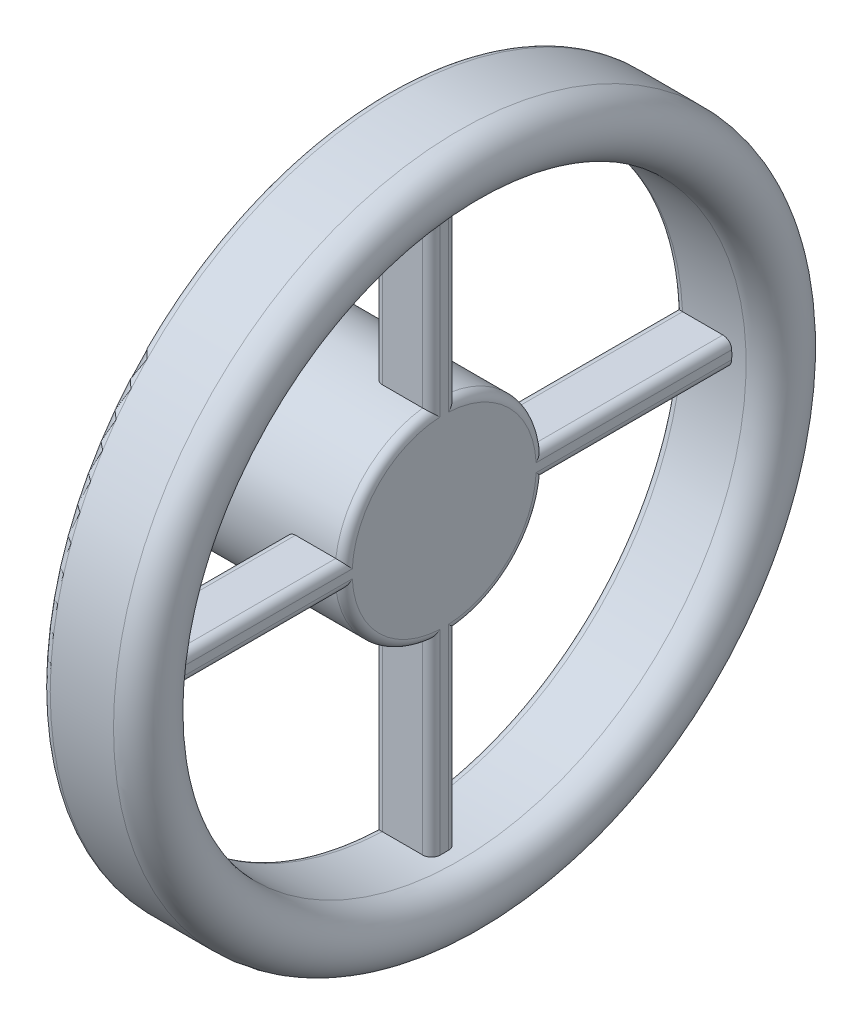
ISO-10303-21;
HEADER;
FILE_DESCRIPTION(('STEP AP214'),'2;1');
FILE_NAME('part.step','',(''),(''),'','','');
FILE_SCHEMA(('AUTOMOTIVE_DESIGN { 1 0 10303 214 1 1 1 1 }'));
ENDSEC;
DATA;
#1=APPLICATION_CONTEXT('core data for automotive mechanical design processes');
#2=APPLICATION_PROTOCOL_DEFINITION('international standard','automotive_design',2000,#1);
#3=PRODUCT_CONTEXT('',#1,'mechanical');
#4=PRODUCT('Part','Part','',(#3));
#5=PRODUCT_RELATED_PRODUCT_CATEGORY('part','',(#4));
#6=PRODUCT_DEFINITION_FORMATION('','',#4);
#7=PRODUCT_DEFINITION_CONTEXT('part definition',#1,'design');
#8=PRODUCT_DEFINITION('design','',#6,#7);
#9=PRODUCT_DEFINITION_SHAPE('','',#8);
#10=(LENGTH_UNIT() NAMED_UNIT(*) SI_UNIT(.MILLI.,.METRE.));
#11=(NAMED_UNIT(*) PLANE_ANGLE_UNIT() SI_UNIT($,.RADIAN.));
#12=(NAMED_UNIT(*) SI_UNIT($,.STERADIAN.) SOLID_ANGLE_UNIT());
#13=UNCERTAINTY_MEASURE_WITH_UNIT(LENGTH_MEASURE(1.E-05),#10,'distance_accuracy_value','');
#14=(GEOMETRIC_REPRESENTATION_CONTEXT(3) GLOBAL_UNCERTAINTY_ASSIGNED_CONTEXT((#13)) GLOBAL_UNIT_ASSIGNED_CONTEXT((#10,
#11,#12)) REPRESENTATION_CONTEXT('',''));
#15=CARTESIAN_POINT('',(0.,0.,0.));
#16=DIRECTION('',(0.,0.,1.));
#17=DIRECTION('',(1.,0.,0.));
#18=AXIS2_PLACEMENT_3D('',#15,#16,#17);
#19=CARTESIAN_POINT('',(0.,0.,0.45));
#20=DIRECTION('',(0.,0.,1.));
#21=DIRECTION('',(1.,0.,0.));
#22=AXIS2_PLACEMENT_3D('',#19,#20,#21);
#23=PLANE('',#22);
#24=DIRECTION('',(-1.,0.,0.));
#25=VECTOR('',#24,1.);
#26=CARTESIAN_POINT('',(0.,9.98986986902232,0.45));
#27=LINE('',#26,#25);
#28=CARTESIAN_POINT('',(5.3,9.98986986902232,0.45));
#29=VERTEX_POINT('',#28);
#30=CARTESIAN_POINT('',(6.7,9.98986986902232,0.45));
#31=VERTEX_POINT('',#30);
#32=EDGE_CURVE('E290',#29,#31,#27,.F.);
#33=ORIENTED_EDGE('',*,*,#32,.F.);
#34=DIRECTION('',(0.,-1.,0.));
#35=VECTOR('',#34,1.);
#36=CARTESIAN_POINT('',(5.3,3.47095087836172,0.45));
#37=LINE('',#36,#35);
#38=CARTESIAN_POINT('',(5.3,3.47095087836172,0.45));
#39=VERTEX_POINT('',#38);
#40=EDGE_CURVE('E689',#29,#39,#37,.T.);
#41=ORIENTED_EDGE('',*,*,#40,.T.);
#42=DIRECTION('',(-1.,0.,0.));
#43=VECTOR('',#42,1.);
#44=CARTESIAN_POINT('',(7.,3.47095087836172,0.45));
#45=LINE('',#44,#43);
#46=CARTESIAN_POINT('',(6.7,3.47095087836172,0.45));
#47=VERTEX_POINT('',#46);
#48=EDGE_CURVE('E506',#39,#47,#45,.F.);
#49=ORIENTED_EDGE('',*,*,#48,.T.);
#50=DIRECTION('',(0.,1.,0.));
#51=VECTOR('',#50,1.);
#52=CARTESIAN_POINT('',(6.7,9.98986986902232,0.45));
#53=LINE('',#52,#51);
#54=EDGE_CURVE('E276',#47,#31,#53,.T.);
#55=ORIENTED_EDGE('',*,*,#54,.T.);
#56=EDGE_LOOP('',(#33,#41,#49,#55));
#57=FACE_BOUND('',#56,.T.);
#58=ADVANCED_FACE('F45',(#57),#23,.T.);
#59=CARTESIAN_POINT('',(0.,0.,-0.45));
#60=DIRECTION('',(0.,0.,1.));
#61=DIRECTION('',(1.,0.,0.));
#62=AXIS2_PLACEMENT_3D('',#59,#60,#61);
#63=PLANE('',#62);
#64=DIRECTION('',(-1.,0.,0.));
#65=VECTOR('',#64,1.);
#66=CARTESIAN_POINT('',(7.,3.47095087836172,-0.45));
#67=LINE('',#66,#65);
#68=CARTESIAN_POINT('',(5.3,3.47095087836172,-0.45));
#69=VERTEX_POINT('',#68);
#70=CARTESIAN_POINT('',(6.7,3.47095087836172,-0.45));
#71=VERTEX_POINT('',#70);
#72=EDGE_CURVE('E293',#69,#71,#67,.F.);
#73=ORIENTED_EDGE('',*,*,#72,.F.);
#74=DIRECTION('',(0.,-1.,0.));
#75=VECTOR('',#74,1.);
#76=CARTESIAN_POINT('',(5.3,0.,-0.45));
#77=LINE('',#76,#75);
#78=CARTESIAN_POINT('',(5.3,9.98986986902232,-0.45));
#79=VERTEX_POINT('',#78);
#80=EDGE_CURVE('E685',#69,#79,#77,.F.);
#81=ORIENTED_EDGE('',*,*,#80,.T.);
#82=DIRECTION('',(-1.,0.,0.));
#83=VECTOR('',#82,1.);
#84=CARTESIAN_POINT('',(0.,9.98986986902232,-0.45));
#85=LINE('',#84,#83);
#86=CARTESIAN_POINT('',(6.7,9.98986986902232,-0.45));
#87=VERTEX_POINT('',#86);
#88=EDGE_CURVE('E291',#79,#87,#85,.F.);
#89=ORIENTED_EDGE('',*,*,#88,.T.);
#90=DIRECTION('',(0.,1.,0.));
#91=VECTOR('',#90,1.);
#92=CARTESIAN_POINT('',(6.7,0.,-0.45));
#93=LINE('',#92,#91);
#94=EDGE_CURVE('E271',#87,#71,#93,.F.);
#95=ORIENTED_EDGE('',*,*,#94,.T.);
#96=EDGE_LOOP('',(#73,#81,#89,#95));
#97=FACE_BOUND('',#96,.T.);
#98=ADVANCED_FACE('F482',(#97),#63,.F.);
#99=CARTESIAN_POINT('',(0.,0.,0.));
#100=DIRECTION('',(-1.,0.,0.));
#101=DIRECTION('',(0.,0.,1.));
#102=AXIS2_PLACEMENT_3D('',#99,#100,#101);
#103=CYLINDRICAL_SURFACE('',#102,12.);
#104=CARTESIAN_POINT('',(5.3,0.,0.));
#105=DIRECTION('',(1.,0.,0.));
#106=DIRECTION('',(0.,0.,-1.));
#107=AXIS2_PLACEMENT_3D('',#104,#105,#106);
#108=CIRCLE('',#107,12.);
#109=CARTESIAN_POINT('',(5.3,0.,-12.));
#110=VERTEX_POINT('',#109);
#111=EDGE_CURVE('E700',#110,#110,#108,.T.);
#112=ORIENTED_EDGE('',*,*,#111,.T.);
#113=EDGE_LOOP('',(#112));
#114=FACE_BOUND('',#113,.T.);
#115=CARTESIAN_POINT('',(7.5,0.,0.));
#116=DIRECTION('',(-1.,0.,0.));
#117=DIRECTION('',(0.,0.,1.));
#118=AXIS2_PLACEMENT_3D('',#115,#116,#117);
#119=CIRCLE('',#118,12.);
#120=CARTESIAN_POINT('',(7.5,0.,12.));
#121=VERTEX_POINT('',#120);
#122=EDGE_CURVE('E503',#121,#121,#119,.T.);
#123=ORIENTED_EDGE('',*,*,#122,.T.);
#124=EDGE_LOOP('',(#123));
#125=FACE_BOUND('',#124,.T.);
#126=ADVANCED_FACE('F325',(#114,#125),#103,.T.);
#127=CARTESIAN_POINT('',(5.,12.,0.));
#128=DIRECTION('',(1.,0.,0.));
#129=DIRECTION('',(0.,0.,-1.));
#130=AXIS2_PLACEMENT_3D('',#127,#128,#129);
#131=PLANE('',#130);
#132=CARTESIAN_POINT('',(5.,0.,0.));
#133=DIRECTION('',(1.,0.,0.));
#134=DIRECTION('',(0.,0.,-1.));
#135=AXIS2_PLACEMENT_3D('',#132,#133,#134);
#136=CIRCLE('',#135,3.5);
#137=CARTESIAN_POINT('',(5.,-3.49678423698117,0.15));
#138=VERTEX_POINT('',#137);
#139=CARTESIAN_POINT('',(5.,-3.49678423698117,-0.15));
#140=VERTEX_POINT('',#139);
#141=EDGE_CURVE('E872',#138,#140,#136,.T.);
#142=ORIENTED_EDGE('',*,*,#141,.T.);
#143=DIRECTION('',(0.,1.,0.));
#144=VECTOR('',#143,1.);
#145=CARTESIAN_POINT('',(5.,-9.98986986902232,-0.15));
#146=LINE('',#145,#144);
#147=CARTESIAN_POINT('',(5.,-10.2989077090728,-0.15));
#148=VERTEX_POINT('',#147);
#149=EDGE_CURVE('E760',#140,#148,#146,.F.);
#150=ORIENTED_EDGE('',*,*,#149,.T.);
#151=CARTESIAN_POINT('',(5.,0.,0.));
#152=DIRECTION('',(1.,0.,0.));
#153=DIRECTION('',(0.,0.,-1.));
#154=AXIS2_PLACEMENT_3D('',#151,#152,#153);
#155=CIRCLE('',#154,10.3);
#156=CARTESIAN_POINT('',(5.,-0.149999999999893,-10.2989077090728));
#157=VERTEX_POINT('',#156);
#158=EDGE_CURVE('E756',#148,#157,#155,.T.);
#159=ORIENTED_EDGE('',*,*,#158,.T.);
#160=DIRECTION('',(0.,0.,1.));
#161=VECTOR('',#160,1.);
#162=CARTESIAN_POINT('',(5.,-0.150000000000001,-1.27264494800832E-13));
#163=LINE('',#162,#161);
#164=CARTESIAN_POINT('',(5.,-0.149999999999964,-3.49678423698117));
#165=VERTEX_POINT('',#164);
#166=EDGE_CURVE('E758',#157,#165,#163,.T.);
#167=ORIENTED_EDGE('',*,*,#166,.T.);
#168=CARTESIAN_POINT('',(5.,0.,0.));
#169=DIRECTION('',(1.,0.,0.));
#170=DIRECTION('',(0.,0.,-1.));
#171=AXIS2_PLACEMENT_3D('',#168,#169,#170);
#172=CIRCLE('',#171,3.5);
#173=CARTESIAN_POINT('',(5.,0.150000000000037,-3.49678423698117));
#174=VERTEX_POINT('',#173);
#175=EDGE_CURVE('E675',#165,#174,#172,.T.);
#176=ORIENTED_EDGE('',*,*,#175,.T.);
#177=DIRECTION('',(0.,0.,1.));
#178=VECTOR('',#177,1.);
#179=CARTESIAN_POINT('',(5.,0.150000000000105,-9.98986986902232));
#180=LINE('',#179,#178);
#181=CARTESIAN_POINT('',(5.,0.150000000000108,-10.2989077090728));
#182=VERTEX_POINT('',#181);
#183=EDGE_CURVE('E744',#174,#182,#180,.F.);
#184=ORIENTED_EDGE('',*,*,#183,.T.);
#185=CARTESIAN_POINT('',(5.,0.,0.));
#186=DIRECTION('',(1.,0.,0.));
#187=DIRECTION('',(0.,0.,-1.));
#188=AXIS2_PLACEMENT_3D('',#185,#186,#187);
#189=CIRCLE('',#188,10.3);
#190=CARTESIAN_POINT('',(5.,10.2989077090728,-0.15));
#191=VERTEX_POINT('',#190);
#192=EDGE_CURVE('E748',#182,#191,#189,.T.);
#193=ORIENTED_EDGE('',*,*,#192,.T.);
#194=DIRECTION('',(0.,-1.,0.));
#195=VECTOR('',#194,1.);
#196=CARTESIAN_POINT('',(5.,12.,-0.15));
#197=LINE('',#196,#195);
#198=CARTESIAN_POINT('',(5.,3.49678423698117,-0.15));
#199=VERTEX_POINT('',#198);
#200=EDGE_CURVE('E736',#191,#199,#197,.T.);
#201=ORIENTED_EDGE('',*,*,#200,.T.);
#202=CARTESIAN_POINT('',(5.,0.,0.));
#203=DIRECTION('',(1.,0.,0.));
#204=DIRECTION('',(0.,0.,-1.));
#205=AXIS2_PLACEMENT_3D('',#202,#203,#204);
#206=CIRCLE('',#205,3.5);
#207=CARTESIAN_POINT('',(5.,3.49678423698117,0.15));
#208=VERTEX_POINT('',#207);
#209=EDGE_CURVE('E511',#208,#199,#206,.F.);
#210=ORIENTED_EDGE('',*,*,#209,.F.);
#211=DIRECTION('',(0.,-1.,0.));
#212=VECTOR('',#211,1.);
#213=CARTESIAN_POINT('',(5.,9.98986986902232,0.15));
#214=LINE('',#213,#212);
#215=CARTESIAN_POINT('',(5.,10.2989077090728,0.15));
#216=VERTEX_POINT('',#215);
#217=EDGE_CURVE('E777',#208,#216,#214,.F.);
#218=ORIENTED_EDGE('',*,*,#217,.T.);
#219=CARTESIAN_POINT('',(5.,0.,0.));
#220=DIRECTION('',(1.,0.,0.));
#221=DIRECTION('',(0.,0.,-1.));
#222=AXIS2_PLACEMENT_3D('',#219,#220,#221);
#223=CIRCLE('',#222,10.3);
#224=CARTESIAN_POINT('',(5.,0.149999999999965,10.2989077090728));
#225=VERTEX_POINT('',#224);
#226=EDGE_CURVE('E780',#216,#225,#223,.T.);
#227=ORIENTED_EDGE('',*,*,#226,.T.);
#228=DIRECTION('',(0.,0.,-1.));
#229=VECTOR('',#228,1.);
#230=CARTESIAN_POINT('',(5.,0.150000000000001,0.));
#231=LINE('',#230,#229);
#232=CARTESIAN_POINT('',(5.,0.149999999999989,3.49678423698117));
#233=VERTEX_POINT('',#232);
#234=EDGE_CURVE('E779',#225,#233,#231,.T.);
#235=ORIENTED_EDGE('',*,*,#234,.T.);
#236=CARTESIAN_POINT('',(5.,0.,0.));
#237=DIRECTION('',(1.,0.,0.));
#238=DIRECTION('',(0.,0.,-1.));
#239=AXIS2_PLACEMENT_3D('',#236,#237,#238);
#240=CIRCLE('',#239,3.5);
#241=CARTESIAN_POINT('',(5.,-0.150000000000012,3.49678423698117));
#242=VERTEX_POINT('',#241);
#243=EDGE_CURVE('E849',#233,#242,#240,.T.);
#244=ORIENTED_EDGE('',*,*,#243,.T.);
#245=DIRECTION('',(0.,0.,-1.));
#246=VECTOR('',#245,1.);
#247=CARTESIAN_POINT('',(5.,-0.150000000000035,9.98986986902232));
#248=LINE('',#247,#246);
#249=CARTESIAN_POINT('',(5.,-0.150000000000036,10.2989077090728));
#250=VERTEX_POINT('',#249);
#251=EDGE_CURVE('E746',#242,#250,#248,.F.);
#252=ORIENTED_EDGE('',*,*,#251,.T.);
#253=CARTESIAN_POINT('',(5.,0.,0.));
#254=DIRECTION('',(1.,0.,0.));
#255=DIRECTION('',(0.,0.,-1.));
#256=AXIS2_PLACEMENT_3D('',#253,#254,#255);
#257=CIRCLE('',#256,10.3);
#258=CARTESIAN_POINT('',(5.,-10.2989077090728,0.15));
#259=VERTEX_POINT('',#258);
#260=EDGE_CURVE('E743',#250,#259,#257,.T.);
#261=ORIENTED_EDGE('',*,*,#260,.T.);
#262=DIRECTION('',(0.,1.,0.));
#263=VECTOR('',#262,1.);
#264=CARTESIAN_POINT('',(5.,12.,0.15));
#265=LINE('',#264,#263);
#266=EDGE_CURVE('E753',#259,#138,#265,.T.);
#267=ORIENTED_EDGE('',*,*,#266,.T.);
#268=EDGE_LOOP('',(#142,#150,#159,#167,#176,#184,#193,#201,#210,#218,#227,#235,#244,#252,#261,#267));
#269=FACE_BOUND('',#268,.T.);
#270=CARTESIAN_POINT('',(5.,0.,0.));
#271=DIRECTION('',(1.,0.,0.));
#272=DIRECTION('',(0.,0.,-1.));
#273=AXIS2_PLACEMENT_3D('',#270,#271,#272);
#274=CIRCLE('',#273,11.7);
#275=CARTESIAN_POINT('',(5.,0.,-11.7));
#276=VERTEX_POINT('',#275);
#277=EDGE_CURVE('E783',#276,#276,#274,.F.);
#278=ORIENTED_EDGE('',*,*,#277,.T.);
#279=EDGE_LOOP('',(#278));
#280=FACE_BOUND('',#279,.T.);
#281=ADVANCED_FACE('F498',(#269,#280),#131,.F.);
#282=CARTESIAN_POINT('',(0.,0.,0.));
#283=DIRECTION('',(-1.,0.,0.));
#284=DIRECTION('',(0.,0.,1.));
#285=AXIS2_PLACEMENT_3D('',#282,#283,#284);
#286=CYLINDRICAL_SURFACE('',#285,10.);
#287=CARTESIAN_POINT('',(7.5,0.,0.));
#288=DIRECTION('',(-1.,0.,0.));
#289=DIRECTION('',(0.,0.,1.));
#290=AXIS2_PLACEMENT_3D('',#287,#288,#289);
#291=CIRCLE('',#290,10.);
#292=CARTESIAN_POINT('',(7.5,0.,10.));
#293=VERTEX_POINT('',#292);
#294=EDGE_CURVE('E295',#293,#293,#291,.T.);
#295=ORIENTED_EDGE('',*,*,#294,.F.);
#296=EDGE_LOOP('',(#295));
#297=FACE_BOUND('',#296,.T.);
#298=DIRECTION('',(-1.,0.,0.));
#299=VECTOR('',#298,1.);
#300=CARTESIAN_POINT('',(0.,-0.449999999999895,-9.98986986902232));
#301=LINE('',#300,#299);
#302=CARTESIAN_POINT('',(5.3,-0.449999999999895,-9.98986986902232));
#303=VERTEX_POINT('',#302);
#304=CARTESIAN_POINT('',(6.7,-0.449999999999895,-9.98986986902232));
#305=VERTEX_POINT('',#304);
#306=EDGE_CURVE('E538',#303,#305,#301,.F.);
#307=ORIENTED_EDGE('',*,*,#306,.F.);
#308=CARTESIAN_POINT('',(5.3,0.,0.));
#309=DIRECTION('',(1.,0.,0.));
#310=DIRECTION('',(0.,0.,-1.));
#311=AXIS2_PLACEMENT_3D('',#308,#309,#310);
#312=CIRCLE('',#311,10.);
#313=CARTESIAN_POINT('',(5.3,-9.98986986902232,-0.45));
#314=VERTEX_POINT('',#313);
#315=EDGE_CURVE('E698',#303,#314,#312,.F.);
#316=ORIENTED_EDGE('',*,*,#315,.T.);
#317=DIRECTION('',(-1.,0.,0.));
#318=VECTOR('',#317,1.);
#319=CARTESIAN_POINT('',(0.,-9.98986986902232,-0.45));
#320=LINE('',#319,#318);
#321=CARTESIAN_POINT('',(6.7,-9.98986986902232,-0.45));
#322=VERTEX_POINT('',#321);
#323=EDGE_CURVE('E529',#314,#322,#320,.F.);
#324=ORIENTED_EDGE('',*,*,#323,.T.);
#325=CARTESIAN_POINT('',(6.7,-9.98986986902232,-0.45));
#326=CARTESIAN_POINT('',(6.71686743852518,-9.9898680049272,-0.450014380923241));
#327=CARTESIAN_POINT('',(6.73373043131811,-9.98993389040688,-0.448578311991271));
#328=CARTESIAN_POINT('',(6.76696558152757,-9.9901873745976,-0.442911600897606));
#329=CARTESIAN_POINT('',(6.78333813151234,-9.99037487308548,-0.438683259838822));
#330=CARTESIAN_POINT('',(6.81514715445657,-9.9908579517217,-0.427535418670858));
#331=CARTESIAN_POINT('',(6.83058318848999,-9.99115358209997,-0.420614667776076));
#332=CARTESIAN_POINT('',(6.86007192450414,-9.99182769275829,-0.404284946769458));
#333=CARTESIAN_POINT('',(6.87412485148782,-9.99220615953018,-0.394876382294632));
#334=CARTESIAN_POINT('',(6.90046032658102,-9.99301563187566,-0.373830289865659));
#335=CARTESIAN_POINT('',(6.912741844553,-9.99344666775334,-0.362191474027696));
#336=CARTESIAN_POINT('',(6.93517971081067,-9.99432733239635,-0.337015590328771));
#337=CARTESIAN_POINT('',(6.94533563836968,-9.99477696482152,-0.323478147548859));
#338=CARTESIAN_POINT('',(6.9632393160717,-9.99566159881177,-0.294879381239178));
#339=CARTESIAN_POINT('',(6.97098494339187,-9.99609658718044,-0.27981672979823));
#340=CARTESIAN_POINT('',(6.98383289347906,-9.99692141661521,-0.248606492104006));
#341=CARTESIAN_POINT('',(6.98893676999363,-9.99731128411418,-0.23245954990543));
#342=CARTESIAN_POINT('',(6.99509119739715,-9.99790074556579,-0.205178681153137));
#343=CARTESIAN_POINT('',(6.99693080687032,-9.99811984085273,-0.194216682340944));
#344=CARTESIAN_POINT('',(6.99938506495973,-9.99852387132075,-0.17217142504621));
#345=CARTESIAN_POINT('',(7.00000143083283,-9.99870885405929,-0.161088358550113));
#346=CARTESIAN_POINT('',(7.00000000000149,-9.99887493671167,-0.150000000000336));
#347=B_SPLINE_CURVE_WITH_KNOTS('',3,(#325,#326,#327,#328,#329,#330,#331,#332,#333,#334,#335,
#336,#337,#338,#339,#340,#341,#342,#343,#344,#345,#346),.UNSPECIFIED.,.F.,.F.,(4,2,2,2,2,2,2,2,
2,2,4),(0.,0.0505347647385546,0.101027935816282,0.151544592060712,0.202053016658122,
0.252590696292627,0.303138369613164,0.353730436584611,0.404292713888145,0.437581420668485,
0.470823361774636),.UNSPECIFIED.);
#348=CARTESIAN_POINT('',(7.,-9.99887493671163,-0.15));
#349=VERTEX_POINT('',#348);
#350=EDGE_CURVE('E399',#322,#349,#347,.T.);
#351=ORIENTED_EDGE('',*,*,#350,.T.);
#352=CARTESIAN_POINT('',(7.,0.,0.));
#353=DIRECTION('',(-1.,0.,0.));
#354=DIRECTION('',(0.,0.,1.));
#355=AXIS2_PLACEMENT_3D('',#352,#353,#354);
#356=CIRCLE('',#355,10.);
#357=CARTESIAN_POINT('',(7.,-9.99887493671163,0.15));
#358=VERTEX_POINT('',#357);
#359=EDGE_CURVE('E527',#358,#349,#356,.F.);
#360=ORIENTED_EDGE('',*,*,#359,.F.);
#361=CARTESIAN_POINT('',(7.,-9.99887493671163,0.15));
#362=CARTESIAN_POINT('',(7.00001431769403,-9.99862335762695,0.166879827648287));
#363=CARTESIAN_POINT('',(6.99857622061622,-9.99832585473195,0.183754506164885));
#364=CARTESIAN_POINT('',(6.99290172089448,-9.99765840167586,0.217011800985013));
#365=CARTESIAN_POINT('',(6.98866757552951,-9.99728851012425,0.233394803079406));
#366=CARTESIAN_POINT('',(6.97750459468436,-9.99649502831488,0.265223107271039));
#367=CARTESIAN_POINT('',(6.97057450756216,-9.99607141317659,0.280667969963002));
#368=CARTESIAN_POINT('',(6.95422249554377,-9.99519937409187,0.310172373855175));
#369=CARTESIAN_POINT('',(6.94480098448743,-9.99475095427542,0.32423214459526));
#370=CARTESIAN_POINT('',(6.9237274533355,-9.99386165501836,0.350575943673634));
#371=CARTESIAN_POINT('',(6.91207458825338,-9.99342077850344,0.362859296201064));
#372=CARTESIAN_POINT('',(6.88686806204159,-9.99258084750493,0.385297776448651));
#373=CARTESIAN_POINT('',(6.87331403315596,-9.992181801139,0.395452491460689));
#374=CARTESIAN_POINT('',(6.84469144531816,-9.99145776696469,0.413342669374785));
#375=CARTESIAN_POINT('',(6.82962271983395,-9.99113278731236,0.421077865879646));
#376=CARTESIAN_POINT('',(6.79840162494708,-9.99058400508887,0.433904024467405));
#377=CARTESIAN_POINT('',(6.78224990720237,-9.99036014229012,0.438996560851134));
#378=CARTESIAN_POINT('',(6.75499895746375,-9.99008864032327,0.445123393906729));
#379=CARTESIAN_POINT('',(6.74407183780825,-9.99000687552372,0.446950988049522));
#380=CARTESIAN_POINT('',(6.722098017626,-9.98989738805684,0.44938914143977));
#381=CARTESIAN_POINT('',(6.7110515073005,-9.98986958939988,0.450001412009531));
#382=CARTESIAN_POINT('',(6.70000000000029,-9.98986986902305,0.450000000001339));
#383=B_SPLINE_CURVE_WITH_KNOTS('',3,(#361,#362,#363,#364,#365,#366,#367,#368,#369,#370,#371,
#372,#373,#374,#375,#376,#377,#378,#379,#380,#381,#382),.UNSPECIFIED.,.F.,.F.,(4,2,2,2,2,2,2,2,
2,2,4),(0.,0.0505775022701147,0.101114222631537,0.151674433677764,0.202226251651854,
0.252797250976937,0.303378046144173,0.353964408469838,0.404520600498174,0.437695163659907,
0.470822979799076),.UNSPECIFIED.);
#384=CARTESIAN_POINT('',(6.7,-9.98986986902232,0.45));
#385=VERTEX_POINT('',#384);
#386=EDGE_CURVE('E391',#358,#385,#383,.T.);
#387=ORIENTED_EDGE('',*,*,#386,.T.);
#388=DIRECTION('',(-1.,0.,0.));
#389=VECTOR('',#388,1.);
#390=CARTESIAN_POINT('',(0.,-9.98986986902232,0.45));
#391=LINE('',#390,#389);
#392=CARTESIAN_POINT('',(5.3,-9.98986986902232,0.45));
#393=VERTEX_POINT('',#392);
#394=EDGE_CURVE('E531',#393,#385,#391,.F.);
#395=ORIENTED_EDGE('',*,*,#394,.F.);
#396=CARTESIAN_POINT('',(5.3,0.,0.));
#397=DIRECTION('',(1.,0.,0.));
#398=DIRECTION('',(0.,0.,-1.));
#399=AXIS2_PLACEMENT_3D('',#396,#397,#398);
#400=CIRCLE('',#399,10.);
#401=CARTESIAN_POINT('',(5.3,-0.450000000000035,9.98986986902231));
#402=VERTEX_POINT('',#401);
#403=EDGE_CURVE('E696',#393,#402,#400,.F.);
#404=ORIENTED_EDGE('',*,*,#403,.T.);
#405=DIRECTION('',(-1.,0.,0.));
#406=VECTOR('',#405,1.);
#407=CARTESIAN_POINT('',(0.,-0.450000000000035,9.98986986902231));
#408=LINE('',#407,#406);
#409=CARTESIAN_POINT('',(6.7,-0.450000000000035,9.98986986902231));
#410=VERTEX_POINT('',#409);
#411=EDGE_CURVE('E523',#402,#410,#408,.F.);
#412=ORIENTED_EDGE('',*,*,#411,.T.);
#413=CARTESIAN_POINT('',(6.7,-0.450000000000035,9.98986986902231));
#414=CARTESIAN_POINT('',(6.71686743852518,-0.450014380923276,9.9898680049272));
#415=CARTESIAN_POINT('',(6.73373043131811,-0.448578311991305,9.98993389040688));
#416=CARTESIAN_POINT('',(6.76696558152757,-0.442911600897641,9.9901873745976));
#417=CARTESIAN_POINT('',(6.78333813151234,-0.438683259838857,9.99037487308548));
#418=CARTESIAN_POINT('',(6.81514715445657,-0.427535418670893,9.9908579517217));
#419=CARTESIAN_POINT('',(6.83058318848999,-0.420614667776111,9.99115358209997));
#420=CARTESIAN_POINT('',(6.86007192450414,-0.404284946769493,9.99182769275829));
#421=CARTESIAN_POINT('',(6.87412485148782,-0.394876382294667,9.99220615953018));
#422=CARTESIAN_POINT('',(6.90046032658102,-0.373830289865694,9.99301563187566));
#423=CARTESIAN_POINT('',(6.912741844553,-0.362191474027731,9.99344666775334));
#424=CARTESIAN_POINT('',(6.93517971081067,-0.337015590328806,9.99432733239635));
#425=CARTESIAN_POINT('',(6.94533563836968,-0.323478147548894,9.99477696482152));
#426=CARTESIAN_POINT('',(6.9632393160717,-0.294879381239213,9.99566159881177));
#427=CARTESIAN_POINT('',(6.97098494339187,-0.279816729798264,9.99609658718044));
#428=CARTESIAN_POINT('',(6.98383289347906,-0.248606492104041,9.99692141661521));
#429=CARTESIAN_POINT('',(6.98893676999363,-0.232459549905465,9.99731128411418));
#430=CARTESIAN_POINT('',(6.99509119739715,-0.205178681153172,9.99790074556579));
#431=CARTESIAN_POINT('',(6.99693080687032,-0.194216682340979,9.99811984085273));
#432=CARTESIAN_POINT('',(6.99938506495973,-0.172171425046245,9.99852387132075));
#433=CARTESIAN_POINT('',(7.00000143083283,-0.161088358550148,9.99870885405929));
#434=CARTESIAN_POINT('',(7.00000000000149,-0.150000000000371,9.99887493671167));
#435=B_SPLINE_CURVE_WITH_KNOTS('',3,(#413,#414,#415,#416,#417,#418,#419,#420,#421,#422,#423,
#424,#425,#426,#427,#428,#429,#430,#431,#432,#433,#434),.UNSPECIFIED.,.F.,.F.,(4,2,2,2,2,2,2,2,
2,2,4),(0.,0.0505347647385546,0.101027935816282,0.151544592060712,0.202053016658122,
0.252590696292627,0.303138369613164,0.353730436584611,0.404292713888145,0.437581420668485,
0.470823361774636),.UNSPECIFIED.);
#436=CARTESIAN_POINT('',(7.,-0.150000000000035,9.99887493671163));
#437=VERTEX_POINT('',#436);
#438=EDGE_CURVE('E819',#410,#437,#435,.T.);
#439=ORIENTED_EDGE('',*,*,#438,.T.);
#440=CARTESIAN_POINT('',(7.,0.,0.));
#441=DIRECTION('',(-1.,0.,0.));
#442=DIRECTION('',(0.,0.,1.));
#443=AXIS2_PLACEMENT_3D('',#440,#441,#442);
#444=CIRCLE('',#443,10.);
#445=CARTESIAN_POINT('',(7.,0.149999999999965,9.99887493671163));
#446=VERTEX_POINT('',#445);
#447=EDGE_CURVE('E518',#446,#437,#444,.F.);
#448=ORIENTED_EDGE('',*,*,#447,.F.);
#449=CARTESIAN_POINT('',(7.,0.149999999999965,9.99887493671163));
#450=CARTESIAN_POINT('',(7.00001431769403,0.166879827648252,9.99862335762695));
#451=CARTESIAN_POINT('',(6.99857622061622,0.18375450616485,9.99832585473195));
#452=CARTESIAN_POINT('',(6.99290172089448,0.217011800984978,9.99765840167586));
#453=CARTESIAN_POINT('',(6.98866757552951,0.233394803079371,9.99728851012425));
#454=CARTESIAN_POINT('',(6.97750459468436,0.265223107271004,9.99649502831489));
#455=CARTESIAN_POINT('',(6.97057450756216,0.280667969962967,9.9960714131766));
#456=CARTESIAN_POINT('',(6.95422249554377,0.31017237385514,9.99519937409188));
#457=CARTESIAN_POINT('',(6.94480098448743,0.324232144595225,9.99475095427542));
#458=CARTESIAN_POINT('',(6.9237274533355,0.350575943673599,9.99386165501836));
#459=CARTESIAN_POINT('',(6.91207458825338,0.362859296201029,9.99342077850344));
#460=CARTESIAN_POINT('',(6.88686806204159,0.385297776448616,9.99258084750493));
#461=CARTESIAN_POINT('',(6.87331403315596,0.395452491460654,9.99218180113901));
#462=CARTESIAN_POINT('',(6.84469144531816,0.41334266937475,9.99145776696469));
#463=CARTESIAN_POINT('',(6.82962271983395,0.421077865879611,9.99113278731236));
#464=CARTESIAN_POINT('',(6.79840162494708,0.43390402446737,9.99058400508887));
#465=CARTESIAN_POINT('',(6.78224990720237,0.438996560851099,9.99036014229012));
#466=CARTESIAN_POINT('',(6.75499895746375,0.445123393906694,9.99008864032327));
#467=CARTESIAN_POINT('',(6.74407183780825,0.446950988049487,9.99000687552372));
#468=CARTESIAN_POINT('',(6.722098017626,0.449389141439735,9.98989738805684));
#469=CARTESIAN_POINT('',(6.7110515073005,0.450001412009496,9.98986958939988));
#470=CARTESIAN_POINT('',(6.70000000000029,0.450000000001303,9.98986986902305));
#471=B_SPLINE_CURVE_WITH_KNOTS('',3,(#449,#450,#451,#452,#453,#454,#455,#456,#457,#458,#459,
#460,#461,#462,#463,#464,#465,#466,#467,#468,#469,#470),.UNSPECIFIED.,.F.,.F.,(4,2,2,2,2,2,2,2,
2,2,4),(0.,0.0505775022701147,0.101114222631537,0.151674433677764,0.202226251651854,
0.252797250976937,0.303378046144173,0.353964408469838,0.404520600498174,0.437695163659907,
0.470822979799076),.UNSPECIFIED.);
#472=CARTESIAN_POINT('',(6.7,0.449999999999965,9.98986986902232));
#473=VERTEX_POINT('',#472);
#474=EDGE_CURVE('E812',#446,#473,#471,.T.);
#475=ORIENTED_EDGE('',*,*,#474,.T.);
#476=DIRECTION('',(-1.,0.,0.));
#477=VECTOR('',#476,1.);
#478=CARTESIAN_POINT('',(0.,0.449999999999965,9.98986986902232));
#479=LINE('',#478,#477);
#480=CARTESIAN_POINT('',(5.3,0.449999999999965,9.98986986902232));
#481=VERTEX_POINT('',#480);
#482=EDGE_CURVE('E525',#481,#473,#479,.F.);
#483=ORIENTED_EDGE('',*,*,#482,.F.);
#484=CARTESIAN_POINT('',(5.3,0.,0.));
#485=DIRECTION('',(1.,0.,0.));
#486=DIRECTION('',(0.,0.,-1.));
#487=AXIS2_PLACEMENT_3D('',#484,#485,#486);
#488=CIRCLE('',#487,10.);
#489=EDGE_CURVE('E687',#481,#29,#488,.F.);
#490=ORIENTED_EDGE('',*,*,#489,.T.);
#491=ORIENTED_EDGE('',*,*,#32,.T.);
#492=CARTESIAN_POINT('',(6.7,9.98986986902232,0.45));
#493=CARTESIAN_POINT('',(6.71686743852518,9.9898680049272,0.450014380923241));
#494=CARTESIAN_POINT('',(6.73373043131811,9.98993389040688,0.448578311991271));
#495=CARTESIAN_POINT('',(6.76696558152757,9.9901873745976,0.442911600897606));
#496=CARTESIAN_POINT('',(6.78333813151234,9.99037487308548,0.438683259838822));
#497=CARTESIAN_POINT('',(6.81514715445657,9.9908579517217,0.427535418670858));
#498=CARTESIAN_POINT('',(6.83058318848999,9.99115358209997,0.420614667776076));
#499=CARTESIAN_POINT('',(6.86007192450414,9.99182769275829,0.404284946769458));
#500=CARTESIAN_POINT('',(6.87412485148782,9.99220615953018,0.394876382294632));
#501=CARTESIAN_POINT('',(6.90046032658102,9.99301563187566,0.373830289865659));
#502=CARTESIAN_POINT('',(6.912741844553,9.99344666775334,0.362191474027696));
#503=CARTESIAN_POINT('',(6.93517971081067,9.99432733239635,0.337015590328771));
#504=CARTESIAN_POINT('',(6.94533563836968,9.99477696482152,0.323478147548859));
#505=CARTESIAN_POINT('',(6.9632393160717,9.99566159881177,0.294879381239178));
#506=CARTESIAN_POINT('',(6.97098494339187,9.99609658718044,0.27981672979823));
#507=CARTESIAN_POINT('',(6.98383289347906,9.99692141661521,0.248606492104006));
#508=CARTESIAN_POINT('',(6.98893676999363,9.99731128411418,0.23245954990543));
#509=CARTESIAN_POINT('',(6.99509119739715,9.99790074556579,0.205178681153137));
#510=CARTESIAN_POINT('',(6.99693080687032,9.99811984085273,0.194216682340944));
#511=CARTESIAN_POINT('',(6.99938506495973,9.99852387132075,0.17217142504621));
#512=CARTESIAN_POINT('',(7.00000143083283,9.99870885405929,0.161088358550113));
#513=CARTESIAN_POINT('',(7.00000000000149,9.99887493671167,0.150000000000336));
#514=B_SPLINE_CURVE_WITH_KNOTS('',3,(#492,#493,#494,#495,#496,#497,#498,#499,#500,#501,#502,
#503,#504,#505,#506,#507,#508,#509,#510,#511,#512,#513),.UNSPECIFIED.,.F.,.F.,(4,2,2,2,2,2,2,2,
2,2,4),(0.,0.0505347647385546,0.101027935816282,0.151544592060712,0.202053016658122,
0.252590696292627,0.303138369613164,0.353730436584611,0.404292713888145,0.437581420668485,
0.470823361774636),.UNSPECIFIED.);
#515=CARTESIAN_POINT('',(7.,9.99887493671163,0.15));
#516=VERTEX_POINT('',#515);
#517=EDGE_CURVE('E275',#31,#516,#514,.T.);
#518=ORIENTED_EDGE('',*,*,#517,.T.);
#519=CARTESIAN_POINT('',(7.,0.,0.));
#520=DIRECTION('',(-1.,0.,0.));
#521=DIRECTION('',(0.,0.,1.));
#522=AXIS2_PLACEMENT_3D('',#519,#520,#521);
#523=CIRCLE('',#522,10.);
#524=CARTESIAN_POINT('',(7.,9.99887493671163,-0.15));
#525=VERTEX_POINT('',#524);
#526=EDGE_CURVE('E281',#525,#516,#523,.F.);
#527=ORIENTED_EDGE('',*,*,#526,.F.);
#528=CARTESIAN_POINT('',(7.,9.99887493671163,-0.15));
#529=CARTESIAN_POINT('',(7.00001431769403,9.99862335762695,-0.166879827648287));
#530=CARTESIAN_POINT('',(6.99857622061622,9.99832585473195,-0.183754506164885));
#531=CARTESIAN_POINT('',(6.99290172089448,9.99765840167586,-0.217011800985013));
#532=CARTESIAN_POINT('',(6.98866757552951,9.99728851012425,-0.233394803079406));
#533=CARTESIAN_POINT('',(6.97750459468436,9.99649502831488,-0.265223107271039));
#534=CARTESIAN_POINT('',(6.97057450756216,9.99607141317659,-0.280667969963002));
#535=CARTESIAN_POINT('',(6.95422249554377,9.99519937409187,-0.310172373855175));
#536=CARTESIAN_POINT('',(6.94480098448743,9.99475095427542,-0.32423214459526));
#537=CARTESIAN_POINT('',(6.9237274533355,9.99386165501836,-0.350575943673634));
#538=CARTESIAN_POINT('',(6.91207458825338,9.99342077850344,-0.362859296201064));
#539=CARTESIAN_POINT('',(6.88686806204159,9.99258084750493,-0.385297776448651));
#540=CARTESIAN_POINT('',(6.87331403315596,9.992181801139,-0.39545249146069));
#541=CARTESIAN_POINT('',(6.84469144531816,9.99145776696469,-0.413342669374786));
#542=CARTESIAN_POINT('',(6.82962271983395,9.99113278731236,-0.421077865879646));
#543=CARTESIAN_POINT('',(6.79840162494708,9.99058400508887,-0.433904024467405));
#544=CARTESIAN_POINT('',(6.78224990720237,9.99036014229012,-0.438996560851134));
#545=CARTESIAN_POINT('',(6.75499895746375,9.99008864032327,-0.445123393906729));
#546=CARTESIAN_POINT('',(6.74407183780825,9.99000687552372,-0.446950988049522));
#547=CARTESIAN_POINT('',(6.722098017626,9.98989738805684,-0.44938914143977));
#548=CARTESIAN_POINT('',(6.7110515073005,9.98986958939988,-0.450001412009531));
#549=CARTESIAN_POINT('',(6.70000000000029,9.98986986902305,-0.450000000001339));
#550=B_SPLINE_CURVE_WITH_KNOTS('',3,(#528,#529,#530,#531,#532,#533,#534,#535,#536,#537,#538,
#539,#540,#541,#542,#543,#544,#545,#546,#547,#548,#549),.UNSPECIFIED.,.F.,.F.,(4,2,2,2,2,2,2,2,
2,2,4),(0.,0.0505775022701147,0.101114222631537,0.151674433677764,0.202226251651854,
0.252797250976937,0.303378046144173,0.353964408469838,0.404520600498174,0.437695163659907,
0.470822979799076),.UNSPECIFIED.);
#551=EDGE_CURVE('E265',#525,#87,#550,.T.);
#552=ORIENTED_EDGE('',*,*,#551,.T.);
#553=ORIENTED_EDGE('',*,*,#88,.F.);
#554=CARTESIAN_POINT('',(5.3,0.,0.));
#555=DIRECTION('',(1.,0.,0.));
#556=DIRECTION('',(0.,0.,-1.));
#557=AXIS2_PLACEMENT_3D('',#554,#555,#556);
#558=CIRCLE('',#557,10.);
#559=CARTESIAN_POINT('',(5.3,0.450000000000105,-9.98986986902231));
#560=VERTEX_POINT('',#559);
#561=EDGE_CURVE('E694',#79,#560,#558,.F.);
#562=ORIENTED_EDGE('',*,*,#561,.T.);
#563=DIRECTION('',(-1.,0.,0.));
#564=VECTOR('',#563,1.);
#565=CARTESIAN_POINT('',(0.,0.450000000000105,-9.98986986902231));
#566=LINE('',#565,#564);
#567=CARTESIAN_POINT('',(6.7,0.450000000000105,-9.98986986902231));
#568=VERTEX_POINT('',#567);
#569=EDGE_CURVE('E536',#560,#568,#566,.F.);
#570=ORIENTED_EDGE('',*,*,#569,.T.);
#571=CARTESIAN_POINT('',(6.7,0.450000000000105,-9.98986986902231));
#572=CARTESIAN_POINT('',(6.71686743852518,0.450014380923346,-9.9898680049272));
#573=CARTESIAN_POINT('',(6.73373043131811,0.448578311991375,-9.98993389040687));
#574=CARTESIAN_POINT('',(6.76696558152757,0.442911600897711,-9.9901873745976));
#575=CARTESIAN_POINT('',(6.78333813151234,0.438683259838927,-9.99037487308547));
#576=CARTESIAN_POINT('',(6.81514715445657,0.427535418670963,-9.9908579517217));
#577=CARTESIAN_POINT('',(6.83058318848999,0.420614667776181,-9.99115358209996));
#578=CARTESIAN_POINT('',(6.86007192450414,0.404284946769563,-9.99182769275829));
#579=CARTESIAN_POINT('',(6.87412485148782,0.394876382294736,-9.99220615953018));
#580=CARTESIAN_POINT('',(6.90046032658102,0.373830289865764,-9.99301563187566));
#581=CARTESIAN_POINT('',(6.912741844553,0.362191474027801,-9.99344666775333));
#582=CARTESIAN_POINT('',(6.93517971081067,0.337015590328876,-9.99432733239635));
#583=CARTESIAN_POINT('',(6.94533563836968,0.323478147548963,-9.99477696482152));
#584=CARTESIAN_POINT('',(6.9632393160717,0.294879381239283,-9.99566159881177));
#585=CARTESIAN_POINT('',(6.97098494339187,0.279816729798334,-9.99609658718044));
#586=CARTESIAN_POINT('',(6.98383289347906,0.248606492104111,-9.99692141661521));
#587=CARTESIAN_POINT('',(6.98893676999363,0.232459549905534,-9.99731128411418));
#588=CARTESIAN_POINT('',(6.99509119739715,0.205178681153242,-9.99790074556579));
#589=CARTESIAN_POINT('',(6.99693080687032,0.194216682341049,-9.99811984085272));
#590=CARTESIAN_POINT('',(6.99938506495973,0.172171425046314,-9.99852387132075));
#591=CARTESIAN_POINT('',(7.00000143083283,0.161088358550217,-9.99870885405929));
#592=CARTESIAN_POINT('',(7.00000000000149,0.150000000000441,-9.99887493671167));
#593=B_SPLINE_CURVE_WITH_KNOTS('',3,(#571,#572,#573,#574,#575,#576,#577,#578,#579,#580,#581,
#582,#583,#584,#585,#586,#587,#588,#589,#590,#591,#592),.UNSPECIFIED.,.F.,.F.,(4,2,2,2,2,2,2,2,
2,2,4),(0.,0.0505347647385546,0.101027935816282,0.151544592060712,0.202053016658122,
0.252590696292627,0.303138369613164,0.353730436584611,0.404292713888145,0.437581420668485,
0.470823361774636),.UNSPECIFIED.);
#594=CARTESIAN_POINT('',(7.,0.150000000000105,-9.99887493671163));
#595=VERTEX_POINT('',#594);
#596=EDGE_CURVE('E423',#568,#595,#593,.T.);
#597=ORIENTED_EDGE('',*,*,#596,.T.);
#598=CARTESIAN_POINT('',(7.,0.,0.));
#599=DIRECTION('',(-1.,0.,0.));
#600=DIRECTION('',(0.,0.,1.));
#601=AXIS2_PLACEMENT_3D('',#598,#599,#600);
#602=CIRCLE('',#601,10.);
#603=CARTESIAN_POINT('',(7.,-0.149999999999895,-9.99887493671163));
#604=VERTEX_POINT('',#603);
#605=EDGE_CURVE('E533',#604,#595,#602,.F.);
#606=ORIENTED_EDGE('',*,*,#605,.F.);
#607=CARTESIAN_POINT('',(7.,-0.149999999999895,-9.99887493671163));
#608=CARTESIAN_POINT('',(7.00001431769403,-0.166879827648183,-9.99862335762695));
#609=CARTESIAN_POINT('',(6.99857622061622,-0.18375450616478,-9.99832585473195));
#610=CARTESIAN_POINT('',(6.99290172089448,-0.217011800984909,-9.99765840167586));
#611=CARTESIAN_POINT('',(6.98866757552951,-0.233394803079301,-9.99728851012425));
#612=CARTESIAN_POINT('',(6.97750459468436,-0.265223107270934,-9.99649502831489));
#613=CARTESIAN_POINT('',(6.97057450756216,-0.280667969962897,-9.9960714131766));
#614=CARTESIAN_POINT('',(6.95422249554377,-0.310172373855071,-9.99519937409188));
#615=CARTESIAN_POINT('',(6.94480098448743,-0.324232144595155,-9.99475095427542));
#616=CARTESIAN_POINT('',(6.9237274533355,-0.350575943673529,-9.99386165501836));
#617=CARTESIAN_POINT('',(6.91207458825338,-0.362859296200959,-9.99342077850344));
#618=CARTESIAN_POINT('',(6.88686806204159,-0.385297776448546,-9.99258084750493));
#619=CARTESIAN_POINT('',(6.87331403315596,-0.395452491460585,-9.99218180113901));
#620=CARTESIAN_POINT('',(6.84469144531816,-0.413342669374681,-9.9914577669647));
#621=CARTESIAN_POINT('',(6.82962271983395,-0.421077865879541,-9.99113278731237));
#622=CARTESIAN_POINT('',(6.79840162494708,-0.4339040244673,-9.99058400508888));
#623=CARTESIAN_POINT('',(6.78224990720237,-0.438996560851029,-9.99036014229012));
#624=CARTESIAN_POINT('',(6.75499895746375,-0.445123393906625,-9.99008864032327));
#625=CARTESIAN_POINT('',(6.74407183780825,-0.446950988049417,-9.99000687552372));
#626=CARTESIAN_POINT('',(6.722098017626,-0.449389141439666,-9.98989738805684));
#627=CARTESIAN_POINT('',(6.7110515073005,-0.450001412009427,-9.98986958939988));
#628=CARTESIAN_POINT('',(6.70000000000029,-0.450000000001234,-9.98986986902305));
#629=B_SPLINE_CURVE_WITH_KNOTS('',3,(#607,#608,#609,#610,#611,#612,#613,#614,#615,#616,#617,
#618,#619,#620,#621,#622,#623,#624,#625,#626,#627,#628),.UNSPECIFIED.,.F.,.F.,(4,2,2,2,2,2,2,2,
2,2,4),(0.,0.0505775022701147,0.101114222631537,0.151674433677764,0.202226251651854,
0.252797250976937,0.303378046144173,0.353964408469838,0.404520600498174,0.437695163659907,
0.470822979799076),.UNSPECIFIED.);
#630=EDGE_CURVE('E416',#604,#305,#629,.T.);
#631=ORIENTED_EDGE('',*,*,#630,.T.);
#632=EDGE_LOOP('',(#307,#316,#324,#351,#360,#387,#395,#404,#412,#439,#448,#475,#483,#490,#491,
#518,#527,#552,#553,#562,#570,#597,#606,#631));
#633=FACE_BOUND('',#632,.T.);
#634=ADVANCED_FACE('F288',(#297,#633),#286,.F.);
#635=CARTESIAN_POINT('',(7.5,0.,0.));
#636=DIRECTION('',(-1.,0.,0.));
#637=DIRECTION('',(0.,0.,1.));
#638=AXIS2_PLACEMENT_3D('',#635,#636,#637);
#639=TOROIDAL_SURFACE('',#638,11.,1.);
#640=ORIENTED_EDGE('',*,*,#122,.F.);
#641=EDGE_LOOP('',(#640));
#642=FACE_BOUND('',#641,.T.);
#643=ORIENTED_EDGE('',*,*,#294,.T.);
#644=EDGE_LOOP('',(#643));
#645=FACE_BOUND('',#644,.T.);
#646=ADVANCED_FACE('F492',(#642,#645),#639,.T.);
#647=CARTESIAN_POINT('',(7.,3.5,0.45));
#648=DIRECTION('',(-1.,0.,0.));
#649=DIRECTION('',(0.,0.,1.));
#650=AXIS2_PLACEMENT_3D('',#647,#648,#649);
#651=PLANE('',#650);
#652=CARTESIAN_POINT('',(7.,0.,0.));
#653=DIRECTION('',(-1.,0.,0.));
#654=DIRECTION('',(0.,0.,1.));
#655=AXIS2_PLACEMENT_3D('',#652,#653,#654);
#656=CIRCLE('',#655,3.2);
#657=CARTESIAN_POINT('',(7.,-3.19648244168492,-0.15));
#658=VERTEX_POINT('',#657);
#659=CARTESIAN_POINT('',(7.,-0.149999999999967,-3.19648244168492));
#660=VERTEX_POINT('',#659);
#661=EDGE_CURVE('E592',#658,#660,#656,.F.);
#662=ORIENTED_EDGE('',*,*,#661,.T.);
#663=DIRECTION('',(0.,0.,-1.));
#664=VECTOR('',#663,1.);
#665=CARTESIAN_POINT('',(7.,-0.150000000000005,0.449999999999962));
#666=LINE('',#665,#664);
#667=EDGE_CURVE('E69',#660,#604,#666,.T.);
#668=ORIENTED_EDGE('',*,*,#667,.T.);
#669=ORIENTED_EDGE('',*,*,#605,.T.);
#670=DIRECTION('',(0.,0.,-1.));
#671=VECTOR('',#670,1.);
#672=CARTESIAN_POINT('',(7.,0.150000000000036,-3.47095087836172));
#673=LINE('',#672,#671);
#674=CARTESIAN_POINT('',(7.,0.150000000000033,-3.19648244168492));
#675=VERTEX_POINT('',#674);
#676=EDGE_CURVE('E407',#595,#675,#673,.F.);
#677=ORIENTED_EDGE('',*,*,#676,.T.);
#678=CARTESIAN_POINT('',(7.,0.,0.));
#679=DIRECTION('',(-1.,0.,0.));
#680=DIRECTION('',(0.,0.,1.));
#681=AXIS2_PLACEMENT_3D('',#678,#679,#680);
#682=CIRCLE('',#681,3.2);
#683=CARTESIAN_POINT('',(7.,3.19648244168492,-0.15));
#684=VERTEX_POINT('',#683);
#685=EDGE_CURVE('E284',#675,#684,#682,.F.);
#686=ORIENTED_EDGE('',*,*,#685,.T.);
#687=DIRECTION('',(0.,1.,0.));
#688=VECTOR('',#687,1.);
#689=CARTESIAN_POINT('',(7.,3.5,-0.15));
#690=LINE('',#689,#688);
#691=EDGE_CURVE('E268',#684,#525,#690,.T.);
#692=ORIENTED_EDGE('',*,*,#691,.T.);
#693=ORIENTED_EDGE('',*,*,#526,.T.);
#694=DIRECTION('',(0.,1.,0.));
#695=VECTOR('',#694,1.);
#696=CARTESIAN_POINT('',(7.,3.47095087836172,0.15));
#697=LINE('',#696,#695);
#698=CARTESIAN_POINT('',(7.,3.19648244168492,0.15));
#699=VERTEX_POINT('',#698);
#700=EDGE_CURVE('E285',#516,#699,#697,.F.);
#701=ORIENTED_EDGE('',*,*,#700,.T.);
#702=CARTESIAN_POINT('',(7.,0.,0.));
#703=DIRECTION('',(-1.,0.,0.));
#704=DIRECTION('',(0.,0.,1.));
#705=AXIS2_PLACEMENT_3D('',#702,#703,#704);
#706=CIRCLE('',#705,3.2);
#707=CARTESIAN_POINT('',(7.,0.149999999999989,3.19648244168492));
#708=VERTEX_POINT('',#707);
#709=EDGE_CURVE('E703',#699,#708,#706,.F.);
#710=ORIENTED_EDGE('',*,*,#709,.T.);
#711=DIRECTION('',(0.,0.,1.));
#712=VECTOR('',#711,1.);
#713=CARTESIAN_POINT('',(7.,0.149999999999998,0.449999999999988));
#714=LINE('',#713,#712);
#715=EDGE_CURVE('E800',#708,#446,#714,.T.);
#716=ORIENTED_EDGE('',*,*,#715,.T.);
#717=ORIENTED_EDGE('',*,*,#447,.T.);
#718=DIRECTION('',(0.,0.,1.));
#719=VECTOR('',#718,1.);
#720=CARTESIAN_POINT('',(7.,-0.150000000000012,3.47095087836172));
#721=LINE('',#720,#719);
#722=CARTESIAN_POINT('',(7.,-0.150000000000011,3.19648244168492));
#723=VERTEX_POINT('',#722);
#724=EDGE_CURVE('E798',#437,#723,#721,.F.);
#725=ORIENTED_EDGE('',*,*,#724,.T.);
#726=CARTESIAN_POINT('',(7.,0.,0.));
#727=DIRECTION('',(-1.,0.,0.));
#728=DIRECTION('',(0.,0.,1.));
#729=AXIS2_PLACEMENT_3D('',#726,#727,#728);
#730=CIRCLE('',#729,3.2);
#731=CARTESIAN_POINT('',(7.,-3.19648244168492,0.15));
#732=VERTEX_POINT('',#731);
#733=EDGE_CURVE('E706',#723,#732,#730,.F.);
#734=ORIENTED_EDGE('',*,*,#733,.T.);
#735=DIRECTION('',(0.,-1.,0.));
#736=VECTOR('',#735,1.);
#737=CARTESIAN_POINT('',(7.,3.5,0.15));
#738=LINE('',#737,#736);
#739=EDGE_CURVE('E918',#732,#358,#738,.T.);
#740=ORIENTED_EDGE('',*,*,#739,.T.);
#741=ORIENTED_EDGE('',*,*,#359,.T.);
#742=DIRECTION('',(0.,-1.,0.));
#743=VECTOR('',#742,1.);
#744=CARTESIAN_POINT('',(7.,-3.47095087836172,-0.15));
#745=LINE('',#744,#743);
#746=EDGE_CURVE('E77',#349,#658,#745,.F.);
#747=ORIENTED_EDGE('',*,*,#746,.T.);
#748=EDGE_LOOP('',(#662,#668,#669,#677,#686,#692,#693,#701,#710,#716,#717,#725,#734,#740,#741,#747));
#749=FACE_BOUND('',#748,.T.);
#750=ADVANCED_FACE('F280',(#749),#651,.F.);
#751=CARTESIAN_POINT('',(7.,0.,0.));
#752=DIRECTION('',(-1.,0.,0.));
#753=DIRECTION('',(0.,0.,1.));
#754=AXIS2_PLACEMENT_3D('',#751,#752,#753);
#755=CYLINDRICAL_SURFACE('',#754,3.5);
#756=CARTESIAN_POINT('',(0.3,0.,0.));
#757=DIRECTION('',(1.,0.,0.));
#758=DIRECTION('',(0.,0.,-1.));
#759=AXIS2_PLACEMENT_3D('',#756,#757,#758);
#760=CIRCLE('',#759,3.5);
#761=CARTESIAN_POINT('',(0.3,0.,-3.5));
#762=VERTEX_POINT('',#761);
#763=EDGE_CURVE('E856',#762,#762,#760,.T.);
#764=ORIENTED_EDGE('',*,*,#763,.T.);
#765=EDGE_LOOP('',(#764));
#766=FACE_BOUND('',#765,.T.);
#767=DIRECTION('',(-1.,0.,0.));
#768=VECTOR('',#767,1.);
#769=CARTESIAN_POINT('',(7.,-0.449999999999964,-3.47095087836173));
#770=LINE('',#769,#768);
#771=CARTESIAN_POINT('',(6.7,-0.449999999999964,-3.47095087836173));
#772=VERTEX_POINT('',#771);
#773=CARTESIAN_POINT('',(5.3,-0.449999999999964,-3.47095087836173));
#774=VERTEX_POINT('',#773);
#775=EDGE_CURVE('E672',#772,#774,#770,.T.);
#776=ORIENTED_EDGE('',*,*,#775,.F.);
#777=CARTESIAN_POINT('',(6.7,0.,0.));
#778=DIRECTION('',(-1.,0.,0.));
#779=DIRECTION('',(0.,0.,1.));
#780=AXIS2_PLACEMENT_3D('',#777,#778,#779);
#781=CIRCLE('',#780,3.5);
#782=CARTESIAN_POINT('',(6.7,-3.47095087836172,-0.45));
#783=VERTEX_POINT('',#782);
#784=EDGE_CURVE('E713',#772,#783,#781,.T.);
#785=ORIENTED_EDGE('',*,*,#784,.T.);
#786=DIRECTION('',(-1.,0.,0.));
#787=VECTOR('',#786,1.);
#788=CARTESIAN_POINT('',(7.,-3.47095087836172,-0.45));
#789=LINE('',#788,#787);
#790=CARTESIAN_POINT('',(5.3,-3.47095087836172,-0.45));
#791=VERTEX_POINT('',#790);
#792=EDGE_CURVE('E682',#783,#791,#789,.T.);
#793=ORIENTED_EDGE('',*,*,#792,.T.);
#794=CARTESIAN_POINT('',(5.3,-3.47095087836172,-0.45));
#795=CARTESIAN_POINT('',(5.28320474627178,-3.4709454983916,-0.450014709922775));
#796=CARTESIAN_POINT('',(5.26641511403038,-3.47113356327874,-0.448590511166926));
#797=CARTESIAN_POINT('',(5.23333115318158,-3.47185655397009,-0.442974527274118));
#798=CARTESIAN_POINT('',(5.21703629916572,-3.47239109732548,-0.438785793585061));
#799=CARTESIAN_POINT('',(5.1853812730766,-3.4737674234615,-0.427748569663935));
#800=CARTESIAN_POINT('',(5.17002143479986,-3.47460931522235,-0.420899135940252));
#801=CARTESIAN_POINT('',(5.14067123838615,-3.4765281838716,-0.404744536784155));
#802=CARTESIAN_POINT('',(5.12668078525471,-3.47760514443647,-0.395439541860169));
#803=CARTESIAN_POINT('',(5.10039011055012,-3.47991315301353,-0.374585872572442));
#804=CARTESIAN_POINT('',(5.08809832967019,-3.48114491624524,-0.363026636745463));
#805=CARTESIAN_POINT('',(5.06562204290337,-3.48366236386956,-0.338015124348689));
#806=CARTESIAN_POINT('',(5.05543798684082,-3.48494805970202,-0.324562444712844));
#807=CARTESIAN_POINT('',(5.03741071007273,-3.48748552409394,-0.296058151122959));
#808=CARTESIAN_POINT('',(5.02958146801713,-3.48873705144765,-0.280997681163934));
#809=CARTESIAN_POINT('',(5.01657103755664,-3.4911116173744,-0.249768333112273));
#810=CARTESIAN_POINT('',(5.01138825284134,-3.49223473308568,-0.233600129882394));
#811=CARTESIAN_POINT('',(5.00507853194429,-3.4939430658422,-0.206115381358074));
#812=CARTESIAN_POINT('',(5.00317591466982,-3.49458293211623,-0.1949741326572));
#813=CARTESIAN_POINT('',(5.00063665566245,-3.4957618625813,-0.172557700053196));
#814=CARTESIAN_POINT('',(4.99999838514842,-3.49630105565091,-0.161282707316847));
#815=CARTESIAN_POINT('',(4.99999999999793,-3.49678423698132,-0.150000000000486));
#816=B_SPLINE_CURVE_WITH_KNOTS('',3,(#794,#795,#796,#797,#798,#799,#800,#801,#802,#803,#804,
#805,#806,#807,#808,#809,#810,#811,#812,#813,#814,#815),.UNSPECIFIED.,.F.,.F.,(4,2,2,2,2,2,2,2,
2,2,4),(0.,0.0503161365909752,0.100576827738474,0.150855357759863,0.201130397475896,
0.251646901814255,0.302174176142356,0.352995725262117,0.403786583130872,0.437681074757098,
0.471531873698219),.UNSPECIFIED.);
#817=EDGE_CURVE('E584',#791,#140,#816,.T.);
#818=ORIENTED_EDGE('',*,*,#817,.T.);
#819=ORIENTED_EDGE('',*,*,#141,.F.);
#820=CARTESIAN_POINT('',(5.,-3.49678423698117,0.15));
#821=CARTESIAN_POINT('',(4.99998580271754,-3.49606413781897,0.166896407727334));
#822=CARTESIAN_POINT('',(5.00142653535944,-3.49521257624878,0.183781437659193));
#823=CARTESIAN_POINT('',(5.00710596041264,-3.49330209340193,0.217046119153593));
#824=CARTESIAN_POINT('',(5.01134194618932,-3.49224337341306,0.233426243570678));
#825=CARTESIAN_POINT('',(5.02250234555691,-3.48997213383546,0.265238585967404));
#826=CARTESIAN_POINT('',(5.02942770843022,-3.48875956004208,0.280670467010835));
#827=CARTESIAN_POINT('',(5.04576349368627,-3.48626250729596,0.310148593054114));
#828=CARTESIAN_POINT('',(5.05517368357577,-3.48497803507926,0.324194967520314));
#829=CARTESIAN_POINT('',(5.07625089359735,-3.48242559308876,0.350554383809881));
#830=CARTESIAN_POINT('',(5.08792502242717,-3.48115768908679,0.362861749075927));
#831=CARTESIAN_POINT('',(5.11318731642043,-3.47874085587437,0.38534426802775));
#832=CARTESIAN_POINT('',(5.12677582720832,-3.47759194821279,0.395519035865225));
#833=CARTESIAN_POINT('',(5.15547604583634,-3.4755073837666,0.413436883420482));
#834=CARTESIAN_POINT('',(5.17058704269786,-3.47457162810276,0.421181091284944));
#835=CARTESIAN_POINT('',(5.20190710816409,-3.47299212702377,0.434013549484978));
#836=CARTESIAN_POINT('',(5.21811543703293,-3.47234818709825,0.439103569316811));
#837=CARTESIAN_POINT('',(5.24535659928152,-3.47157236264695,0.445186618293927));
#838=CARTESIAN_POINT('',(5.25621241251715,-3.47134011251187,0.446990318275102));
#839=CARTESIAN_POINT('',(5.27804386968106,-3.47102907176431,0.449396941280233));
#840=CARTESIAN_POINT('',(5.28901933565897,-3.47095007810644,0.450001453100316));
#841=CARTESIAN_POINT('',(5.3,-3.47095087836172,0.45));
#842=B_SPLINE_CURVE_WITH_KNOTS('',3,(#820,#821,#822,#823,#824,#825,#826,#827,#828,#829,#830,
#831,#832,#833,#834,#835,#836,#837,#838,#839,#840,#841),.UNSPECIFIED.,.F.,.F.,(4,2,2,2,2,2,2,2,
2,2,4),(0.,0.0506651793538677,0.101281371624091,0.15191544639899,0.202544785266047,
0.253335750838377,0.304135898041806,0.35491243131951,0.405655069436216,0.43861377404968,
0.471528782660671),.UNSPECIFIED.);
#843=CARTESIAN_POINT('',(5.3,-3.47095087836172,0.45));
#844=VERTEX_POINT('',#843);
#845=EDGE_CURVE('E591',#138,#844,#842,.T.);
#846=ORIENTED_EDGE('',*,*,#845,.T.);
#847=DIRECTION('',(-1.,0.,0.));
#848=VECTOR('',#847,1.);
#849=CARTESIAN_POINT('',(7.,-3.47095087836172,0.45));
#850=LINE('',#849,#848);
#851=CARTESIAN_POINT('',(6.7,-3.47095087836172,0.45));
#852=VERTEX_POINT('',#851);
#853=EDGE_CURVE('E874',#852,#844,#850,.T.);
#854=ORIENTED_EDGE('',*,*,#853,.F.);
#855=CARTESIAN_POINT('',(6.7,0.,0.));
#856=DIRECTION('',(-1.,0.,0.));
#857=DIRECTION('',(0.,0.,1.));
#858=AXIS2_PLACEMENT_3D('',#855,#856,#857);
#859=CIRCLE('',#858,3.5);
#860=CARTESIAN_POINT('',(6.7,-0.450000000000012,3.47095087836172));
#861=VERTEX_POINT('',#860);
#862=EDGE_CURVE('E851',#852,#861,#859,.T.);
#863=ORIENTED_EDGE('',*,*,#862,.T.);
#864=DIRECTION('',(-1.,0.,0.));
#865=VECTOR('',#864,1.);
#866=CARTESIAN_POINT('',(7.,-0.450000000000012,3.47095087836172));
#867=LINE('',#866,#865);
#868=CARTESIAN_POINT('',(5.3,-0.450000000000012,3.47095087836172));
#869=VERTEX_POINT('',#868);
#870=EDGE_CURVE('E879',#861,#869,#867,.T.);
#871=ORIENTED_EDGE('',*,*,#870,.T.);
#872=CARTESIAN_POINT('',(5.3,-0.450000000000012,3.47095087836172));
#873=CARTESIAN_POINT('',(5.28320474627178,-0.450014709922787,3.4709454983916));
#874=CARTESIAN_POINT('',(5.26641511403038,-0.448590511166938,3.47113356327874));
#875=CARTESIAN_POINT('',(5.23333115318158,-0.44297452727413,3.47185655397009));
#876=CARTESIAN_POINT('',(5.21703629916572,-0.438785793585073,3.47239109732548));
#877=CARTESIAN_POINT('',(5.1853812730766,-0.427748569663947,3.4737674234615));
#878=CARTESIAN_POINT('',(5.17002143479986,-0.420899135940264,3.47460931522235));
#879=CARTESIAN_POINT('',(5.14067123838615,-0.404744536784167,3.4765281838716));
#880=CARTESIAN_POINT('',(5.12668078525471,-0.395439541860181,3.47760514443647));
#881=CARTESIAN_POINT('',(5.10039011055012,-0.374585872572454,3.47991315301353));
#882=CARTESIAN_POINT('',(5.08809832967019,-0.363026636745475,3.48114491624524));
#883=CARTESIAN_POINT('',(5.06562204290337,-0.338015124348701,3.48366236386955));
#884=CARTESIAN_POINT('',(5.05543798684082,-0.324562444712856,3.48494805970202));
#885=CARTESIAN_POINT('',(5.03741071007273,-0.296058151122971,3.48748552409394));
#886=CARTESIAN_POINT('',(5.02958146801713,-0.280997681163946,3.48873705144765));
#887=CARTESIAN_POINT('',(5.01657103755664,-0.249768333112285,3.4911116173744));
#888=CARTESIAN_POINT('',(5.01138825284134,-0.233600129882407,3.49223473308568));
#889=CARTESIAN_POINT('',(5.00507853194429,-0.206115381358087,3.4939430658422));
#890=CARTESIAN_POINT('',(5.00317591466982,-0.194974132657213,3.49458293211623));
#891=CARTESIAN_POINT('',(5.00063665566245,-0.172557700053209,3.4957618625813));
#892=CARTESIAN_POINT('',(4.99999838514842,-0.16128270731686,3.49630105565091));
#893=CARTESIAN_POINT('',(4.99999999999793,-0.150000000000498,3.49678423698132));
#894=B_SPLINE_CURVE_WITH_KNOTS('',3,(#872,#873,#874,#875,#876,#877,#878,#879,#880,#881,#882,
#883,#884,#885,#886,#887,#888,#889,#890,#891,#892,#893),.UNSPECIFIED.,.F.,.F.,(4,2,2,2,2,2,2,2,
2,2,4),(0.,0.0503161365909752,0.100576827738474,0.150855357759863,0.201130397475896,
0.251646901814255,0.302174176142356,0.352995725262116,0.403786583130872,0.437681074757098,
0.471531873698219),.UNSPECIFIED.);
#895=EDGE_CURVE('E599',#869,#242,#894,.T.);
#896=ORIENTED_EDGE('',*,*,#895,.T.);
#897=ORIENTED_EDGE('',*,*,#243,.F.);
#898=CARTESIAN_POINT('',(5.,0.149999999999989,3.49678423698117));
#899=CARTESIAN_POINT('',(4.99998580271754,0.166896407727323,3.49606413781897));
#900=CARTESIAN_POINT('',(5.00142653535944,0.183781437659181,3.49521257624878));
#901=CARTESIAN_POINT('',(5.00710596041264,0.217046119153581,3.49330209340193));
#902=CARTESIAN_POINT('',(5.01134194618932,0.233426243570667,3.49224337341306));
#903=CARTESIAN_POINT('',(5.02250234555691,0.265238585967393,3.48997213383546));
#904=CARTESIAN_POINT('',(5.02942770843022,0.280670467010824,3.48875956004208));
#905=CARTESIAN_POINT('',(5.04576349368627,0.310148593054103,3.48626250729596));
#906=CARTESIAN_POINT('',(5.05517368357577,0.324194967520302,3.48497803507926));
#907=CARTESIAN_POINT('',(5.07625089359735,0.35055438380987,3.48242559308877));
#908=CARTESIAN_POINT('',(5.08792502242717,0.362861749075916,3.48115768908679));
#909=CARTESIAN_POINT('',(5.11318731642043,0.385344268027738,3.47874085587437));
#910=CARTESIAN_POINT('',(5.12677582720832,0.395519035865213,3.47759194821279));
#911=CARTESIAN_POINT('',(5.15547604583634,0.413436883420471,3.4755073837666));
#912=CARTESIAN_POINT('',(5.17058704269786,0.421181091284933,3.47457162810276));
#913=CARTESIAN_POINT('',(5.20190710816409,0.434013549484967,3.47299212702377));
#914=CARTESIAN_POINT('',(5.21811543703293,0.4391035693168,3.47234818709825));
#915=CARTESIAN_POINT('',(5.24535659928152,0.445186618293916,3.47157236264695));
#916=CARTESIAN_POINT('',(5.25621241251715,0.44699031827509,3.47134011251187));
#917=CARTESIAN_POINT('',(5.27804386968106,0.449396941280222,3.47102907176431));
#918=CARTESIAN_POINT('',(5.28901933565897,0.450001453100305,3.47095007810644));
#919=CARTESIAN_POINT('',(5.3,0.449999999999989,3.47095087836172));
#920=B_SPLINE_CURVE_WITH_KNOTS('',3,(#898,#899,#900,#901,#902,#903,#904,#905,#906,#907,#908,
#909,#910,#911,#912,#913,#914,#915,#916,#917,#918,#919),.UNSPECIFIED.,.F.,.F.,(4,2,2,2,2,2,2,2,
2,2,4),(0.,0.0506651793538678,0.101281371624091,0.15191544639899,0.202544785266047,
0.253335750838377,0.304135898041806,0.35491243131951,0.405655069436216,0.438613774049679,
0.471528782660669),.UNSPECIFIED.);
#921=CARTESIAN_POINT('',(5.3,0.449999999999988,3.47095087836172));
#922=VERTEX_POINT('',#921);
#923=EDGE_CURVE('E657',#233,#922,#920,.T.);
#924=ORIENTED_EDGE('',*,*,#923,.T.);
#925=DIRECTION('',(-1.,0.,0.));
#926=VECTOR('',#925,1.);
#927=CARTESIAN_POINT('',(7.,0.449999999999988,3.47095087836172));
#928=LINE('',#927,#926);
#929=CARTESIAN_POINT('',(6.7,0.449999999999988,3.47095087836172));
#930=VERTEX_POINT('',#929);
#931=EDGE_CURVE('E845',#930,#922,#928,.T.);
#932=ORIENTED_EDGE('',*,*,#931,.F.);
#933=CARTESIAN_POINT('',(6.7,0.,0.));
#934=DIRECTION('',(-1.,0.,0.));
#935=DIRECTION('',(0.,0.,1.));
#936=AXIS2_PLACEMENT_3D('',#933,#934,#935);
#937=CIRCLE('',#936,3.5);
#938=EDGE_CURVE('E775',#930,#47,#937,.T.);
#939=ORIENTED_EDGE('',*,*,#938,.T.);
#940=ORIENTED_EDGE('',*,*,#48,.F.);
#941=CARTESIAN_POINT('',(5.3,3.47095087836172,0.45));
#942=CARTESIAN_POINT('',(5.28320474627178,3.4709454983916,0.450014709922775));
#943=CARTESIAN_POINT('',(5.26641511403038,3.47113356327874,0.448590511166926));
#944=CARTESIAN_POINT('',(5.23333115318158,3.47185655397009,0.442974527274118));
#945=CARTESIAN_POINT('',(5.21703629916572,3.47239109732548,0.438785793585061));
#946=CARTESIAN_POINT('',(5.1853812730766,3.4737674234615,0.427748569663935));
#947=CARTESIAN_POINT('',(5.17002143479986,3.47460931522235,0.420899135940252));
#948=CARTESIAN_POINT('',(5.14067123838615,3.4765281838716,0.404744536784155));
#949=CARTESIAN_POINT('',(5.12668078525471,3.47760514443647,0.395439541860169));
#950=CARTESIAN_POINT('',(5.10039011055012,3.47991315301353,0.374585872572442));
#951=CARTESIAN_POINT('',(5.08809832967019,3.48114491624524,0.363026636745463));
#952=CARTESIAN_POINT('',(5.06562204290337,3.48366236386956,0.338015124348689));
#953=CARTESIAN_POINT('',(5.05543798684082,3.48494805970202,0.324562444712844));
#954=CARTESIAN_POINT('',(5.03741071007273,3.48748552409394,0.296058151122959));
#955=CARTESIAN_POINT('',(5.02958146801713,3.48873705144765,0.280997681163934));
#956=CARTESIAN_POINT('',(5.01657103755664,3.4911116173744,0.249768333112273));
#957=CARTESIAN_POINT('',(5.01138825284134,3.49223473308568,0.233600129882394));
#958=CARTESIAN_POINT('',(5.00507853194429,3.4939430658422,0.206115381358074));
#959=CARTESIAN_POINT('',(5.00317591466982,3.49458293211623,0.1949741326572));
#960=CARTESIAN_POINT('',(5.00063665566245,3.4957618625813,0.172557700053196));
#961=CARTESIAN_POINT('',(4.99999838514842,3.49630105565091,0.161282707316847));
#962=CARTESIAN_POINT('',(4.99999999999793,3.49678423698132,0.150000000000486));
#963=B_SPLINE_CURVE_WITH_KNOTS('',3,(#941,#942,#943,#944,#945,#946,#947,#948,#949,#950,#951,
#952,#953,#954,#955,#956,#957,#958,#959,#960,#961,#962),.UNSPECIFIED.,.F.,.F.,(4,2,2,2,2,2,2,2,
2,2,4),(0.,0.0503161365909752,0.100576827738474,0.150855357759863,0.201130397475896,
0.251646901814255,0.302174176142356,0.352995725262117,0.403786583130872,0.437681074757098,
0.471531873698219),.UNSPECIFIED.);
#964=EDGE_CURVE('E651',#39,#208,#963,.T.);
#965=ORIENTED_EDGE('',*,*,#964,.T.);
#966=ORIENTED_EDGE('',*,*,#209,.T.);
#967=CARTESIAN_POINT('',(5.,3.49678423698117,-0.15));
#968=CARTESIAN_POINT('',(4.99998580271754,3.49606413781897,-0.166896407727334));
#969=CARTESIAN_POINT('',(5.00142653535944,3.49521257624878,-0.183781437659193));
#970=CARTESIAN_POINT('',(5.00710596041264,3.49330209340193,-0.217046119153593));
#971=CARTESIAN_POINT('',(5.01134194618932,3.49224337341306,-0.233426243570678));
#972=CARTESIAN_POINT('',(5.02250234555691,3.48997213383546,-0.265238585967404));
#973=CARTESIAN_POINT('',(5.02942770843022,3.48875956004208,-0.280670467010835));
#974=CARTESIAN_POINT('',(5.04576349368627,3.48626250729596,-0.310148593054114));
#975=CARTESIAN_POINT('',(5.05517368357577,3.48497803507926,-0.324194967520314));
#976=CARTESIAN_POINT('',(5.07625089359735,3.48242559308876,-0.350554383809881));
#977=CARTESIAN_POINT('',(5.08792502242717,3.48115768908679,-0.362861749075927));
#978=CARTESIAN_POINT('',(5.11318731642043,3.47874085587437,-0.38534426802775));
#979=CARTESIAN_POINT('',(5.12677582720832,3.47759194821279,-0.395519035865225));
#980=CARTESIAN_POINT('',(5.15547604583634,3.4755073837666,-0.413436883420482));
#981=CARTESIAN_POINT('',(5.17058704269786,3.47457162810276,-0.421181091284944));
#982=CARTESIAN_POINT('',(5.20190710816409,3.47299212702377,-0.434013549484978));
#983=CARTESIAN_POINT('',(5.21811543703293,3.47234818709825,-0.439103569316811));
#984=CARTESIAN_POINT('',(5.24535659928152,3.47157236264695,-0.445186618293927));
#985=CARTESIAN_POINT('',(5.25621241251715,3.47134011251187,-0.446990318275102));
#986=CARTESIAN_POINT('',(5.27804386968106,3.47102907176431,-0.449396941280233));
#987=CARTESIAN_POINT('',(5.28901933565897,3.47095007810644,-0.450001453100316));
#988=CARTESIAN_POINT('',(5.3,3.47095087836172,-0.45));
#989=B_SPLINE_CURVE_WITH_KNOTS('',3,(#967,#968,#969,#970,#971,#972,#973,#974,#975,#976,#977,
#978,#979,#980,#981,#982,#983,#984,#985,#986,#987,#988),.UNSPECIFIED.,.F.,.F.,(4,2,2,2,2,2,2,2,
2,2,4),(0.,0.0506651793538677,0.101281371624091,0.15191544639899,0.202544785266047,
0.253335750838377,0.304135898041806,0.35491243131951,0.405655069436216,0.43861377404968,
0.471528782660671),.UNSPECIFIED.);
#990=EDGE_CURVE('E656',#199,#69,#989,.T.);
#991=ORIENTED_EDGE('',*,*,#990,.T.);
#992=ORIENTED_EDGE('',*,*,#72,.T.);
#993=CARTESIAN_POINT('',(6.7,0.,0.));
#994=DIRECTION('',(-1.,0.,0.));
#995=DIRECTION('',(0.,0.,1.));
#996=AXIS2_PLACEMENT_3D('',#993,#994,#995);
#997=CIRCLE('',#996,3.5);
#998=CARTESIAN_POINT('',(6.7,0.450000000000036,-3.47095087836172));
#999=VERTEX_POINT('',#998);
#1000=EDGE_CURVE('E721',#71,#999,#997,.T.);
#1001=ORIENTED_EDGE('',*,*,#1000,.T.);
#1002=DIRECTION('',(-1.,0.,0.));
#1003=VECTOR('',#1002,1.);
#1004=CARTESIAN_POINT('',(7.,0.450000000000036,-3.47095087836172));
#1005=LINE('',#1004,#1003);
#1006=CARTESIAN_POINT('',(5.3,0.450000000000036,-3.47095087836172));
#1007=VERTEX_POINT('',#1006);
#1008=EDGE_CURVE('E797',#999,#1007,#1005,.T.);
#1009=ORIENTED_EDGE('',*,*,#1008,.T.);
#1010=CARTESIAN_POINT('',(5.3,0.450000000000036,-3.47095087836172));
#1011=CARTESIAN_POINT('',(5.28320474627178,0.450014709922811,-3.4709454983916));
#1012=CARTESIAN_POINT('',(5.26641511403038,0.448590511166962,-3.47113356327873));
#1013=CARTESIAN_POINT('',(5.23333115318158,0.442974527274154,-3.47185655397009));
#1014=CARTESIAN_POINT('',(5.21703629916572,0.438785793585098,-3.47239109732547));
#1015=CARTESIAN_POINT('',(5.1853812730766,0.427748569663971,-3.4737674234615));
#1016=CARTESIAN_POINT('',(5.17002143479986,0.420899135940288,-3.47460931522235));
#1017=CARTESIAN_POINT('',(5.14067123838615,0.404744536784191,-3.4765281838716));
#1018=CARTESIAN_POINT('',(5.12668078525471,0.395439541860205,-3.47760514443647));
#1019=CARTESIAN_POINT('',(5.10039011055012,0.374585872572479,-3.47991315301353));
#1020=CARTESIAN_POINT('',(5.08809832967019,0.3630266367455,-3.48114491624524));
#1021=CARTESIAN_POINT('',(5.06562204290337,0.338015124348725,-3.48366236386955));
#1022=CARTESIAN_POINT('',(5.05543798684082,0.324562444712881,-3.48494805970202));
#1023=CARTESIAN_POINT('',(5.03741071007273,0.296058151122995,-3.48748552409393));
#1024=CARTESIAN_POINT('',(5.02958146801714,0.28099768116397,-3.48873705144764));
#1025=CARTESIAN_POINT('',(5.01657103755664,0.249768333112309,-3.49111161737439));
#1026=CARTESIAN_POINT('',(5.01138825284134,0.233600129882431,-3.49223473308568));
#1027=CARTESIAN_POINT('',(5.00507853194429,0.206115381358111,-3.4939430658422));
#1028=CARTESIAN_POINT('',(5.00317591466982,0.194974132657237,-3.49458293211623));
#1029=CARTESIAN_POINT('',(5.00063665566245,0.172557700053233,-3.49576186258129));
#1030=CARTESIAN_POINT('',(4.99999838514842,0.161282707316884,-3.49630105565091));
#1031=CARTESIAN_POINT('',(4.99999999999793,0.150000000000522,-3.49678423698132));
#1032=B_SPLINE_CURVE_WITH_KNOTS('',3,(#1010,#1011,#1012,#1013,#1014,#1015,#1016,#1017,#1018,
#1019,#1020,#1021,#1022,#1023,#1024,#1025,#1026,#1027,#1028,#1029,#1030,#1031),.UNSPECIFIED.,
.F.,.F.,(4,2,2,2,2,2,2,2,2,2,4),(0.,0.0503161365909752,0.100576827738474,0.150855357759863,
0.201130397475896,0.251646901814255,0.302174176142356,0.352995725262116,0.403786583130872,
0.437681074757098,0.471531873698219),.UNSPECIFIED.);
#1033=EDGE_CURVE('E442',#1007,#174,#1032,.T.);
#1034=ORIENTED_EDGE('',*,*,#1033,.T.);
#1035=ORIENTED_EDGE('',*,*,#175,.F.);
#1036=CARTESIAN_POINT('',(5.,-0.149999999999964,-3.49678423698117));
#1037=CARTESIAN_POINT('',(4.99998580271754,-0.166896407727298,-3.49606413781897));
#1038=CARTESIAN_POINT('',(5.00142653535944,-0.183781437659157,-3.49521257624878));
#1039=CARTESIAN_POINT('',(5.00710596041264,-0.217046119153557,-3.49330209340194));
#1040=CARTESIAN_POINT('',(5.01134194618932,-0.233426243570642,-3.49224337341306));
#1041=CARTESIAN_POINT('',(5.02250234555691,-0.265238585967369,-3.48997213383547));
#1042=CARTESIAN_POINT('',(5.02942770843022,-0.2806704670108,-3.48875956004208));
#1043=CARTESIAN_POINT('',(5.04576349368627,-0.310148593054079,-3.48626250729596));
#1044=CARTESIAN_POINT('',(5.05517368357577,-0.324194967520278,-3.48497803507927));
#1045=CARTESIAN_POINT('',(5.07625089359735,-0.350554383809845,-3.48242559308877));
#1046=CARTESIAN_POINT('',(5.08792502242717,-0.362861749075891,-3.48115768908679));
#1047=CARTESIAN_POINT('',(5.11318731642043,-0.385344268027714,-3.47874085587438));
#1048=CARTESIAN_POINT('',(5.12677582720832,-0.395519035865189,-3.4775919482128));
#1049=CARTESIAN_POINT('',(5.15547604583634,-0.413436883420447,-3.4755073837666));
#1050=CARTESIAN_POINT('',(5.17058704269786,-0.421181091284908,-3.47457162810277));
#1051=CARTESIAN_POINT('',(5.20190710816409,-0.434013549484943,-3.47299212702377));
#1052=CARTESIAN_POINT('',(5.21811543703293,-0.439103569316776,-3.47234818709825));
#1053=CARTESIAN_POINT('',(5.24535659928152,-0.445186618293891,-3.47157236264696));
#1054=CARTESIAN_POINT('',(5.25621241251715,-0.446990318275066,-3.47134011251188));
#1055=CARTESIAN_POINT('',(5.27804386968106,-0.449396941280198,-3.47102907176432));
#1056=CARTESIAN_POINT('',(5.28901933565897,-0.450001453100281,-3.47095007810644));
#1057=CARTESIAN_POINT('',(5.3,-0.449999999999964,-3.47095087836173));
#1058=B_SPLINE_CURVE_WITH_KNOTS('',3,(#1036,#1037,#1038,#1039,#1040,#1041,#1042,#1043,#1044,
#1045,#1046,#1047,#1048,#1049,#1050,#1051,#1052,#1053,#1054,#1055,#1056,#1057),.UNSPECIFIED.,
.F.,.F.,(4,2,2,2,2,2,2,2,2,2,4),(0.,0.0506651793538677,0.101281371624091,0.15191544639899,
0.202544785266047,0.253335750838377,0.304135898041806,0.35491243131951,0.405655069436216,
0.438613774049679,0.471528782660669),.UNSPECIFIED.);
#1059=EDGE_CURVE('E449',#165,#774,#1058,.T.);
#1060=ORIENTED_EDGE('',*,*,#1059,.T.);
#1061=EDGE_LOOP('',(#776,#785,#793,#818,#819,#846,#854,#863,#871,#896,#897,#924,#932,#939,#940,
#965,#966,#991,#992,#1001,#1009,#1034,#1035,#1060));
#1062=FACE_BOUND('',#1061,.T.);
#1063=ADVANCED_FACE('F456',(#766,#1062),#755,.T.);
#1064=CARTESIAN_POINT('',(0.,0.,0.));
#1065=DIRECTION('',(1.,0.,0.));
#1066=DIRECTION('',(0.,0.,-1.));
#1067=AXIS2_PLACEMENT_3D('',#1064,#1065,#1066);
#1068=PLANE('',#1067);
#1069=CARTESIAN_POINT('',(0.,0.,0.));
#1070=DIRECTION('',(1.,0.,0.));
#1071=DIRECTION('',(0.,0.,-1.));
#1072=AXIS2_PLACEMENT_3D('',#1069,#1070,#1071);
#1073=CIRCLE('',#1072,3.2);
#1074=CARTESIAN_POINT('',(0.,0.,-3.2));
#1075=VERTEX_POINT('',#1074);
#1076=EDGE_CURVE('E859',#1075,#1075,#1073,.F.);
#1077=ORIENTED_EDGE('',*,*,#1076,.T.);
#1078=EDGE_LOOP('',(#1077));
#1079=FACE_BOUND('',#1078,.T.);
#1080=CARTESIAN_POINT('',(0.,0.,0.));
#1081=DIRECTION('',(-1.,0.,0.));
#1082=DIRECTION('',(0.,0.,1.));
#1083=AXIS2_PLACEMENT_3D('',#1080,#1081,#1082);
#1084=CIRCLE('',#1083,1.5);
#1085=CARTESIAN_POINT('',(0.,0.,1.5));
#1086=VERTEX_POINT('',#1085);
#1087=EDGE_CURVE('E515',#1086,#1086,#1084,.T.);
#1088=ORIENTED_EDGE('',*,*,#1087,.F.);
#1089=EDGE_LOOP('',(#1088));
#1090=FACE_BOUND('',#1089,.T.);
#1091=ADVANCED_FACE('F940',(#1079,#1090),#1068,.F.);
#1092=CARTESIAN_POINT('',(3.,0.,0.));
#1093=DIRECTION('',(-1.,0.,0.));
#1094=DIRECTION('',(0.,0.,1.));
#1095=AXIS2_PLACEMENT_3D('',#1092,#1093,#1094);
#1096=CYLINDRICAL_SURFACE('',#1095,1.5);
#1097=CARTESIAN_POINT('',(3.,0.,0.));
#1098=DIRECTION('',(-1.,0.,0.));
#1099=DIRECTION('',(0.,0.,1.));
#1100=AXIS2_PLACEMENT_3D('',#1097,#1098,#1099);
#1101=CIRCLE('',#1100,1.5);
#1102=CARTESIAN_POINT('',(3.,0.,1.5));
#1103=VERTEX_POINT('',#1102);
#1104=EDGE_CURVE('E514',#1103,#1103,#1101,.T.);
#1105=ORIENTED_EDGE('',*,*,#1104,.F.);
#1106=EDGE_LOOP('',(#1105));
#1107=FACE_BOUND('',#1106,.T.);
#1108=ORIENTED_EDGE('',*,*,#1087,.T.);
#1109=EDGE_LOOP('',(#1108));
#1110=FACE_BOUND('',#1109,.T.);
#1111=ADVANCED_FACE('F937',(#1107,#1110),#1096,.F.);
#1112=CARTESIAN_POINT('',(3.,0.,0.));
#1113=DIRECTION('',(-1.,0.,0.));
#1114=DIRECTION('',(0.,0.,1.));
#1115=AXIS2_PLACEMENT_3D('',#1112,#1113,#1114);
#1116=PLANE('',#1115);
#1117=ORIENTED_EDGE('',*,*,#1104,.T.);
#1118=EDGE_LOOP('',(#1117));
#1119=FACE_BOUND('',#1118,.T.);
#1120=ADVANCED_FACE('F324',(#1119),#1116,.T.);
#1121=CARTESIAN_POINT('',(6.7,3.5,-0.15));
#1122=DIRECTION('',(0.,1.,0.));
#1123=DIRECTION('',(0.,0.,1.));
#1124=AXIS2_PLACEMENT_3D('',#1121,#1122,#1123);
#1125=CYLINDRICAL_SURFACE('',#1124,0.3);
#1126=ORIENTED_EDGE('',*,*,#691,.F.);
#1127=CARTESIAN_POINT('',(6.7,3.47095087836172,-0.45));
#1128=CARTESIAN_POINT('',(6.71390955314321,3.47096926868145,-0.45002218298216));
#1129=CARTESIAN_POINT('',(6.72779127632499,3.47010220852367,-0.449034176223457));
#1130=CARTESIAN_POINT('',(6.75500148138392,3.46675420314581,-0.445226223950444));
#1131=CARTESIAN_POINT('',(6.7683332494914,3.4642850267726,-0.442419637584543));
#1132=CARTESIAN_POINT('',(6.79413323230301,3.45789231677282,-0.435165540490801));
#1133=CARTESIAN_POINT('',(6.80660315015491,3.45397175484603,-0.430721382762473));
#1134=CARTESIAN_POINT('',(6.83048850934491,3.44488792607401,-0.420447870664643));
#1135=CARTESIAN_POINT('',(6.84190197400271,3.43972239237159,-0.414615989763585));
#1136=CARTESIAN_POINT('',(6.8672137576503,3.42642680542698,-0.399646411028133));
#1137=CARTESIAN_POINT('',(6.8806311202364,3.41788662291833,-0.390059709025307));
#1138=CARTESIAN_POINT('',(6.90520389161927,3.39942823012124,-0.369430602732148));
#1139=CARTESIAN_POINT('',(6.91635542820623,3.38950770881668,-0.358385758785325));
#1140=CARTESIAN_POINT('',(6.939713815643,3.36525721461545,-0.331519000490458));
#1141=CARTESIAN_POINT('',(6.95107954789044,3.35054407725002,-0.315313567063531));
#1142=CARTESIAN_POINT('',(6.97014579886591,3.31997044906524,-0.281880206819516));
#1143=CARTESIAN_POINT('',(6.97784241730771,3.30410875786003,-0.264651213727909));
#1144=CARTESIAN_POINT('',(6.98915730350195,3.27345113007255,-0.231602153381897));
#1145=CARTESIAN_POINT('',(6.9931282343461,3.25872704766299,-0.21583278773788));
#1146=CARTESIAN_POINT('',(6.99847580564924,3.22897549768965,-0.184190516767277));
#1147=CARTESIAN_POINT('',(6.9998573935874,3.21394866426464,-0.168317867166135));
#1148=CARTESIAN_POINT('',(6.99999650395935,3.19807739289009,-0.151671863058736));
#1149=CARTESIAN_POINT('',(6.99999999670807,3.19727997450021,-0.150835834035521));
#1150=CARTESIAN_POINT('',(7.,3.19648244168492,-0.15));
#1151=B_SPLINE_CURVE_WITH_KNOTS('',3,(#1127,#1128,#1129,#1130,#1131,#1132,#1133,#1134,#1135,
#1136,#1137,#1138,#1139,#1140,#1141,#1142,#1143,#1144,#1145,#1146,#1147,#1148,#1149,#1150),
.UNSPECIFIED.,.F.,.F.,(4,2,2,2,2,2,2,2,2,2,2,4),(0.,0.041622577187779,0.0829428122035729,
0.124178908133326,0.165490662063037,0.220898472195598,0.276400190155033,0.349995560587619,
0.423668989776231,0.489325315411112,0.554856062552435,0.558322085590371),.UNSPECIFIED.);
#1152=EDGE_CURVE('E330',#684,#71,#1151,.F.);
#1153=ORIENTED_EDGE('',*,*,#1152,.T.);
#1154=ORIENTED_EDGE('',*,*,#94,.F.);
#1155=ORIENTED_EDGE('',*,*,#551,.F.);
#1156=EDGE_LOOP('',(#1126,#1153,#1154,#1155));
#1157=FACE_BOUND('',#1156,.T.);
#1158=ADVANCED_FACE('F267',(#1157),#1125,.T.);
#1159=CARTESIAN_POINT('',(6.7,0.,0.15));
#1160=DIRECTION('',(0.,-1.,0.));
#1161=DIRECTION('',(0.,0.,-1.));
#1162=AXIS2_PLACEMENT_3D('',#1159,#1160,#1161);
#1163=CYLINDRICAL_SURFACE('',#1162,0.3);
#1164=ORIENTED_EDGE('',*,*,#54,.F.);
#1165=CARTESIAN_POINT('',(6.7,3.47095087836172,0.45));
#1166=CARTESIAN_POINT('',(6.71390955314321,3.47096926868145,0.45002218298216));
#1167=CARTESIAN_POINT('',(6.72779127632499,3.47010220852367,0.449034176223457));
#1168=CARTESIAN_POINT('',(6.75500148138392,3.46675420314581,0.445226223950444));
#1169=CARTESIAN_POINT('',(6.7683332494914,3.4642850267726,0.442419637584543));
#1170=CARTESIAN_POINT('',(6.79413323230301,3.45789231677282,0.435165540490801));
#1171=CARTESIAN_POINT('',(6.80660315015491,3.45397175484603,0.430721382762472));
#1172=CARTESIAN_POINT('',(6.83048850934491,3.44488792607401,0.420447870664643));
#1173=CARTESIAN_POINT('',(6.84190197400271,3.43972239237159,0.414615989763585));
#1174=CARTESIAN_POINT('',(6.8672137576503,3.42642680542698,0.399646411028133));
#1175=CARTESIAN_POINT('',(6.8806311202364,3.41788662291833,0.390059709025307));
#1176=CARTESIAN_POINT('',(6.90520389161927,3.39942823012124,0.369430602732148));
#1177=CARTESIAN_POINT('',(6.91635542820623,3.38950770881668,0.358385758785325));
#1178=CARTESIAN_POINT('',(6.939713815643,3.36525721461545,0.331519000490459));
#1179=CARTESIAN_POINT('',(6.95107954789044,3.35054407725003,0.315313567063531));
#1180=CARTESIAN_POINT('',(6.97014579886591,3.31997044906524,0.281880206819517));
#1181=CARTESIAN_POINT('',(6.97784241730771,3.30410875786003,0.26465121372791));
#1182=CARTESIAN_POINT('',(6.98915730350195,3.27345113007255,0.231602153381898));
#1183=CARTESIAN_POINT('',(6.9931282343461,3.25872704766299,0.21583278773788));
#1184=CARTESIAN_POINT('',(6.99847580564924,3.22897549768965,0.184190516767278));
#1185=CARTESIAN_POINT('',(6.9998573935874,3.21394866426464,0.168317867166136));
#1186=CARTESIAN_POINT('',(6.99999650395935,3.19807739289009,0.151671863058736));
#1187=CARTESIAN_POINT('',(6.99999999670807,3.19727997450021,0.150835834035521));
#1188=CARTESIAN_POINT('',(7.,3.19648244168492,0.15));
#1189=B_SPLINE_CURVE_WITH_KNOTS('',3,(#1165,#1166,#1167,#1168,#1169,#1170,#1171,#1172,#1173,
#1174,#1175,#1176,#1177,#1178,#1179,#1180,#1181,#1182,#1183,#1184,#1185,#1186,#1187,#1188),
.UNSPECIFIED.,.F.,.F.,(4,2,2,2,2,2,2,2,2,2,2,4),(0.,0.041622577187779,0.0829428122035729,
0.124178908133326,0.165490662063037,0.220898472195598,0.276400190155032,0.349995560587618,
0.42366898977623,0.489325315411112,0.554856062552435,0.558322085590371),.UNSPECIFIED.);
#1190=EDGE_CURVE('E13',#47,#699,#1189,.T.);
#1191=ORIENTED_EDGE('',*,*,#1190,.T.);
#1192=ORIENTED_EDGE('',*,*,#700,.F.);
#1193=ORIENTED_EDGE('',*,*,#517,.F.);
#1194=EDGE_LOOP('',(#1164,#1191,#1192,#1193));
#1195=FACE_BOUND('',#1194,.T.);
#1196=ADVANCED_FACE('F323',(#1195),#1163,.T.);
#1197=CARTESIAN_POINT('',(0.,-0.45,0.));
#1198=DIRECTION('',(0.,-1.,0.));
#1199=DIRECTION('',(1.,0.,0.));
#1200=AXIS2_PLACEMENT_3D('',#1197,#1198,#1199);
#1201=PLANE('',#1200);
#1202=ORIENTED_EDGE('',*,*,#411,.F.);
#1203=DIRECTION('',(0.,0.,-1.));
#1204=VECTOR('',#1203,1.);
#1205=CARTESIAN_POINT('',(5.3,-0.450000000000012,3.47095087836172));
#1206=LINE('',#1205,#1204);
#1207=EDGE_CURVE('E764',#402,#869,#1206,.T.);
#1208=ORIENTED_EDGE('',*,*,#1207,.T.);
#1209=ORIENTED_EDGE('',*,*,#870,.F.);
#1210=DIRECTION('',(0.,0.,1.));
#1211=VECTOR('',#1210,1.);
#1212=CARTESIAN_POINT('',(6.7,-0.450000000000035,9.98986986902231));
#1213=LINE('',#1212,#1211);
#1214=EDGE_CURVE('E809',#861,#410,#1213,.T.);
#1215=ORIENTED_EDGE('',*,*,#1214,.T.);
#1216=EDGE_LOOP('',(#1202,#1208,#1209,#1215));
#1217=FACE_BOUND('',#1216,.T.);
#1218=ADVANCED_FACE('F911',(#1217),#1201,.T.);
#1219=CARTESIAN_POINT('',(0.,0.45,0.));
#1220=DIRECTION('',(0.,-1.,0.));
#1221=DIRECTION('',(1.,0.,0.));
#1222=AXIS2_PLACEMENT_3D('',#1219,#1220,#1221);
#1223=PLANE('',#1222);
#1224=ORIENTED_EDGE('',*,*,#931,.T.);
#1225=DIRECTION('',(0.,0.,-1.));
#1226=VECTOR('',#1225,1.);
#1227=CARTESIAN_POINT('',(5.3,0.45,0.));
#1228=LINE('',#1227,#1226);
#1229=EDGE_CURVE('E766',#922,#481,#1228,.F.);
#1230=ORIENTED_EDGE('',*,*,#1229,.T.);
#1231=ORIENTED_EDGE('',*,*,#482,.T.);
#1232=DIRECTION('',(0.,0.,1.));
#1233=VECTOR('',#1232,1.);
#1234=CARTESIAN_POINT('',(6.7,0.45,0.));
#1235=LINE('',#1234,#1233);
#1236=EDGE_CURVE('E806',#473,#930,#1235,.F.);
#1237=ORIENTED_EDGE('',*,*,#1236,.T.);
#1238=EDGE_LOOP('',(#1224,#1230,#1231,#1237));
#1239=FACE_BOUND('',#1238,.T.);
#1240=ADVANCED_FACE('F844',(#1239),#1223,.F.);
#1241=CARTESIAN_POINT('',(0.,0.,-0.45));
#1242=DIRECTION('',(0.,0.,-1.));
#1243=DIRECTION('',(1.,0.,0.));
#1244=AXIS2_PLACEMENT_3D('',#1241,#1242,#1243);
#1245=PLANE('',#1244);
#1246=ORIENTED_EDGE('',*,*,#323,.F.);
#1247=DIRECTION('',(0.,1.,0.));
#1248=VECTOR('',#1247,1.);
#1249=CARTESIAN_POINT('',(5.3,-3.47095087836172,-0.45));
#1250=LINE('',#1249,#1248);
#1251=EDGE_CURVE('E785',#314,#791,#1250,.T.);
#1252=ORIENTED_EDGE('',*,*,#1251,.T.);
#1253=ORIENTED_EDGE('',*,*,#792,.F.);
#1254=DIRECTION('',(0.,-1.,0.));
#1255=VECTOR('',#1254,1.);
#1256=CARTESIAN_POINT('',(6.7,-9.98986986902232,-0.45));
#1257=LINE('',#1256,#1255);
#1258=EDGE_CURVE('E400',#783,#322,#1257,.T.);
#1259=ORIENTED_EDGE('',*,*,#1258,.T.);
#1260=EDGE_LOOP('',(#1246,#1252,#1253,#1259));
#1261=FACE_BOUND('',#1260,.T.);
#1262=ADVANCED_FACE('F867',(#1261),#1245,.T.);
#1263=CARTESIAN_POINT('',(0.,0.,0.45));
#1264=DIRECTION('',(0.,0.,-1.));
#1265=DIRECTION('',(1.,0.,0.));
#1266=AXIS2_PLACEMENT_3D('',#1263,#1264,#1265);
#1267=PLANE('',#1266);
#1268=ORIENTED_EDGE('',*,*,#853,.T.);
#1269=DIRECTION('',(0.,1.,0.));
#1270=VECTOR('',#1269,1.);
#1271=CARTESIAN_POINT('',(5.3,0.,0.45));
#1272=LINE('',#1271,#1270);
#1273=EDGE_CURVE('E762',#844,#393,#1272,.F.);
#1274=ORIENTED_EDGE('',*,*,#1273,.T.);
#1275=ORIENTED_EDGE('',*,*,#394,.T.);
#1276=DIRECTION('',(0.,-1.,0.));
#1277=VECTOR('',#1276,1.);
#1278=CARTESIAN_POINT('',(6.7,0.,0.45));
#1279=LINE('',#1278,#1277);
#1280=EDGE_CURVE('E903',#385,#852,#1279,.F.);
#1281=ORIENTED_EDGE('',*,*,#1280,.T.);
#1282=EDGE_LOOP('',(#1268,#1274,#1275,#1281));
#1283=FACE_BOUND('',#1282,.T.);
#1284=ADVANCED_FACE('F900',(#1283),#1267,.F.);
#1285=CARTESIAN_POINT('',(0.,0.45,0.));
#1286=DIRECTION('',(0.,1.,0.));
#1287=DIRECTION('',(1.,0.,0.));
#1288=AXIS2_PLACEMENT_3D('',#1285,#1286,#1287);
#1289=PLANE('',#1288);
#1290=ORIENTED_EDGE('',*,*,#569,.F.);
#1291=DIRECTION('',(0.,0.,1.));
#1292=VECTOR('',#1291,1.);
#1293=CARTESIAN_POINT('',(5.3,0.450000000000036,-3.47095087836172));
#1294=LINE('',#1293,#1292);
#1295=EDGE_CURVE('E684',#560,#1007,#1294,.T.);
#1296=ORIENTED_EDGE('',*,*,#1295,.T.);
#1297=ORIENTED_EDGE('',*,*,#1008,.F.);
#1298=DIRECTION('',(0.,0.,-1.));
#1299=VECTOR('',#1298,1.);
#1300=CARTESIAN_POINT('',(6.7,0.450000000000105,-9.98986986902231));
#1301=LINE('',#1300,#1299);
#1302=EDGE_CURVE('E413',#999,#568,#1301,.T.);
#1303=ORIENTED_EDGE('',*,*,#1302,.T.);
#1304=EDGE_LOOP('',(#1290,#1296,#1297,#1303));
#1305=FACE_BOUND('',#1304,.T.);
#1306=ADVANCED_FACE('F796',(#1305),#1289,.T.);
#1307=CARTESIAN_POINT('',(0.,-0.45,0.));
#1308=DIRECTION('',(0.,1.,0.));
#1309=DIRECTION('',(1.,0.,0.));
#1310=AXIS2_PLACEMENT_3D('',#1307,#1308,#1309);
#1311=PLANE('',#1310);
#1312=ORIENTED_EDGE('',*,*,#775,.T.);
#1313=DIRECTION('',(0.,0.,1.));
#1314=VECTOR('',#1313,1.);
#1315=CARTESIAN_POINT('',(5.3,-0.45,0.));
#1316=LINE('',#1315,#1314);
#1317=EDGE_CURVE('E680',#774,#303,#1316,.F.);
#1318=ORIENTED_EDGE('',*,*,#1317,.T.);
#1319=ORIENTED_EDGE('',*,*,#306,.T.);
#1320=DIRECTION('',(0.,0.,-1.));
#1321=VECTOR('',#1320,1.);
#1322=CARTESIAN_POINT('',(6.7,-0.45,0.));
#1323=LINE('',#1322,#1321);
#1324=EDGE_CURVE('E410',#305,#772,#1323,.F.);
#1325=ORIENTED_EDGE('',*,*,#1324,.T.);
#1326=EDGE_LOOP('',(#1312,#1318,#1319,#1325));
#1327=FACE_BOUND('',#1326,.T.);
#1328=ADVANCED_FACE('F679',(#1327),#1311,.F.);
#1329=CARTESIAN_POINT('',(6.7,0.149999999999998,0.449999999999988));
#1330=DIRECTION('',(0.,0.,1.));
#1331=DIRECTION('',(0.,-1.,0.));
#1332=AXIS2_PLACEMENT_3D('',#1329,#1330,#1331);
#1333=CYLINDRICAL_SURFACE('',#1332,0.3);
#1334=ORIENTED_EDGE('',*,*,#715,.F.);
#1335=CARTESIAN_POINT('',(6.7,0.449999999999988,3.47095087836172));
#1336=CARTESIAN_POINT('',(6.71390955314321,0.450022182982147,3.47096926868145));
#1337=CARTESIAN_POINT('',(6.72779127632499,0.449034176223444,3.47010220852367));
#1338=CARTESIAN_POINT('',(6.75500148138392,0.445226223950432,3.46675420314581));
#1339=CARTESIAN_POINT('',(6.7683332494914,0.44241963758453,3.4642850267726));
#1340=CARTESIAN_POINT('',(6.79413323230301,0.435165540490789,3.45789231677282));
#1341=CARTESIAN_POINT('',(6.80660315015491,0.43072138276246,3.45397175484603));
#1342=CARTESIAN_POINT('',(6.83048850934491,0.420447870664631,3.44488792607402));
#1343=CARTESIAN_POINT('',(6.84190197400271,0.414615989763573,3.43972239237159));
#1344=CARTESIAN_POINT('',(6.86721375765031,0.399646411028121,3.42642680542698));
#1345=CARTESIAN_POINT('',(6.8806311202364,0.390059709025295,3.41788662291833));
#1346=CARTESIAN_POINT('',(6.90520389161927,0.369430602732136,3.39942823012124));
#1347=CARTESIAN_POINT('',(6.91635542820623,0.358385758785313,3.38950770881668));
#1348=CARTESIAN_POINT('',(6.939713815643,0.331519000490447,3.36525721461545));
#1349=CARTESIAN_POINT('',(6.95107954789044,0.315313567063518,3.35054407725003));
#1350=CARTESIAN_POINT('',(6.97014579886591,0.281880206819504,3.31997044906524));
#1351=CARTESIAN_POINT('',(6.97784241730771,0.264651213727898,3.30410875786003));
#1352=CARTESIAN_POINT('',(6.98915730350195,0.231602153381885,3.27345113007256));
#1353=CARTESIAN_POINT('',(6.9931282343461,0.215832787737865,3.25872704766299));
#1354=CARTESIAN_POINT('',(6.99847580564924,0.184190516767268,3.22897549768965));
#1355=CARTESIAN_POINT('',(6.9998573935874,0.168317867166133,3.21394866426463));
#1356=CARTESIAN_POINT('',(6.99999650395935,0.151671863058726,3.19807739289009));
#1357=CARTESIAN_POINT('',(6.99999999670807,0.15083583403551,3.19727997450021));
#1358=CARTESIAN_POINT('',(7.,0.149999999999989,3.19648244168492));
#1359=B_SPLINE_CURVE_WITH_KNOTS('',3,(#1335,#1336,#1337,#1338,#1339,#1340,#1341,#1342,#1343,
#1344,#1345,#1346,#1347,#1348,#1349,#1350,#1351,#1352,#1353,#1354,#1355,#1356,#1357,#1358),
.UNSPECIFIED.,.F.,.F.,(4,2,2,2,2,2,2,2,2,2,2,4),(0.,0.0416225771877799,0.0829428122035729,
0.124178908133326,0.165490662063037,0.220898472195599,0.276400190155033,0.349995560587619,
0.423668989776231,0.489325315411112,0.554856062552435,0.558322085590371),.UNSPECIFIED.);
#1360=EDGE_CURVE('E61',#708,#930,#1359,.F.);
#1361=ORIENTED_EDGE('',*,*,#1360,.T.);
#1362=ORIENTED_EDGE('',*,*,#1236,.F.);
#1363=ORIENTED_EDGE('',*,*,#474,.F.);
#1364=EDGE_LOOP('',(#1334,#1361,#1362,#1363));
#1365=FACE_BOUND('',#1364,.T.);
#1366=ADVANCED_FACE('F825',(#1365),#1333,.T.);
#1367=CARTESIAN_POINT('',(6.7,-0.15,0.));
#1368=DIRECTION('',(0.,0.,-1.));
#1369=DIRECTION('',(0.,1.,0.));
#1370=AXIS2_PLACEMENT_3D('',#1367,#1368,#1369);
#1371=CYLINDRICAL_SURFACE('',#1370,0.3);
#1372=ORIENTED_EDGE('',*,*,#1214,.F.);
#1373=CARTESIAN_POINT('',(6.7,-0.450000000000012,3.47095087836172));
#1374=CARTESIAN_POINT('',(6.71390955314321,-0.450022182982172,3.47096926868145));
#1375=CARTESIAN_POINT('',(6.72779127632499,-0.449034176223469,3.47010220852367));
#1376=CARTESIAN_POINT('',(6.75500148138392,-0.445226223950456,3.46675420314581));
#1377=CARTESIAN_POINT('',(6.7683332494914,-0.442419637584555,3.4642850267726));
#1378=CARTESIAN_POINT('',(6.79413323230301,-0.435165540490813,3.45789231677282));
#1379=CARTESIAN_POINT('',(6.80660315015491,-0.430721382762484,3.45397175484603));
#1380=CARTESIAN_POINT('',(6.83048850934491,-0.420447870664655,3.44488792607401));
#1381=CARTESIAN_POINT('',(6.84190197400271,-0.414615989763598,3.43972239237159));
#1382=CARTESIAN_POINT('',(6.8672137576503,-0.399646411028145,3.42642680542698));
#1383=CARTESIAN_POINT('',(6.8806311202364,-0.390059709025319,3.41788662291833));
#1384=CARTESIAN_POINT('',(6.90520389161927,-0.36943060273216,3.39942823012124));
#1385=CARTESIAN_POINT('',(6.91635542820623,-0.358385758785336,3.38950770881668));
#1386=CARTESIAN_POINT('',(6.939713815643,-0.33151900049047,3.36525721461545));
#1387=CARTESIAN_POINT('',(6.95107954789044,-0.315313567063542,3.35054407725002));
#1388=CARTESIAN_POINT('',(6.97014579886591,-0.281880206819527,3.31997044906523));
#1389=CARTESIAN_POINT('',(6.97784241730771,-0.26465121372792,3.30410875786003));
#1390=CARTESIAN_POINT('',(6.98915730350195,-0.231602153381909,3.27345113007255));
#1391=CARTESIAN_POINT('',(6.9931282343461,-0.215832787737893,3.25872704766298));
#1392=CARTESIAN_POINT('',(6.99847580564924,-0.184190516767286,3.22897549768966));
#1393=CARTESIAN_POINT('',(6.9998573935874,-0.168317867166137,3.21394866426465));
#1394=CARTESIAN_POINT('',(6.99999650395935,-0.151671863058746,3.19807739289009));
#1395=CARTESIAN_POINT('',(6.99999999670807,-0.150835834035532,3.19727997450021));
#1396=CARTESIAN_POINT('',(7.,-0.150000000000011,3.19648244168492));
#1397=B_SPLINE_CURVE_WITH_KNOTS('',3,(#1373,#1374,#1375,#1376,#1377,#1378,#1379,#1380,#1381,
#1382,#1383,#1384,#1385,#1386,#1387,#1388,#1389,#1390,#1391,#1392,#1393,#1394,#1395,#1396),
.UNSPECIFIED.,.F.,.F.,(4,2,2,2,2,2,2,2,2,2,2,4),(0.,0.041622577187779,0.0829428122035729,
0.124178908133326,0.165490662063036,0.220898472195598,0.276400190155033,0.349995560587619,
0.423668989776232,0.489325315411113,0.554856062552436,0.558322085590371),.UNSPECIFIED.);
#1398=EDGE_CURVE('E338',#861,#723,#1397,.T.);
#1399=ORIENTED_EDGE('',*,*,#1398,.T.);
#1400=ORIENTED_EDGE('',*,*,#724,.F.);
#1401=ORIENTED_EDGE('',*,*,#438,.F.);
#1402=EDGE_LOOP('',(#1372,#1399,#1400,#1401));
#1403=FACE_BOUND('',#1402,.T.);
#1404=ADVANCED_FACE('F384',(#1403),#1371,.T.);
#1405=CARTESIAN_POINT('',(6.7,3.5,0.15));
#1406=DIRECTION('',(0.,-1.,0.));
#1407=DIRECTION('',(0.,0.,-1.));
#1408=AXIS2_PLACEMENT_3D('',#1405,#1406,#1407);
#1409=CYLINDRICAL_SURFACE('',#1408,0.3);
#1410=ORIENTED_EDGE('',*,*,#739,.F.);
#1411=CARTESIAN_POINT('',(6.7,-3.47095087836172,0.45));
#1412=CARTESIAN_POINT('',(6.71390955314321,-3.47096926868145,0.45002218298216));
#1413=CARTESIAN_POINT('',(6.72779127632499,-3.47010220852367,0.449034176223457));
#1414=CARTESIAN_POINT('',(6.75500148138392,-3.46675420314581,0.445226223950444));
#1415=CARTESIAN_POINT('',(6.7683332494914,-3.4642850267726,0.442419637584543));
#1416=CARTESIAN_POINT('',(6.79413323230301,-3.45789231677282,0.435165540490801));
#1417=CARTESIAN_POINT('',(6.80660315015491,-3.45397175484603,0.430721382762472));
#1418=CARTESIAN_POINT('',(6.83048850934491,-3.44488792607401,0.420447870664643));
#1419=CARTESIAN_POINT('',(6.84190197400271,-3.43972239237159,0.414615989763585));
#1420=CARTESIAN_POINT('',(6.8672137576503,-3.42642680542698,0.399646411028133));
#1421=CARTESIAN_POINT('',(6.8806311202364,-3.41788662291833,0.390059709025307));
#1422=CARTESIAN_POINT('',(6.90520389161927,-3.39942823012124,0.369430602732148));
#1423=CARTESIAN_POINT('',(6.91635542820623,-3.38950770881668,0.358385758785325));
#1424=CARTESIAN_POINT('',(6.939713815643,-3.36525721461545,0.331519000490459));
#1425=CARTESIAN_POINT('',(6.95107954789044,-3.35054407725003,0.315313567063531));
#1426=CARTESIAN_POINT('',(6.97014579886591,-3.31997044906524,0.281880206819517));
#1427=CARTESIAN_POINT('',(6.97784241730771,-3.30410875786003,0.26465121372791));
#1428=CARTESIAN_POINT('',(6.98915730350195,-3.27345113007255,0.231602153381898));
#1429=CARTESIAN_POINT('',(6.9931282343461,-3.25872704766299,0.21583278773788));
#1430=CARTESIAN_POINT('',(6.99847580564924,-3.22897549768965,0.184190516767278));
#1431=CARTESIAN_POINT('',(6.9998573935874,-3.21394866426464,0.168317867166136));
#1432=CARTESIAN_POINT('',(6.99999650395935,-3.19807739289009,0.151671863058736));
#1433=CARTESIAN_POINT('',(6.99999999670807,-3.19727997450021,0.150835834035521));
#1434=CARTESIAN_POINT('',(7.,-3.19648244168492,0.15));
#1435=B_SPLINE_CURVE_WITH_KNOTS('',3,(#1411,#1412,#1413,#1414,#1415,#1416,#1417,#1418,#1419,
#1420,#1421,#1422,#1423,#1424,#1425,#1426,#1427,#1428,#1429,#1430,#1431,#1432,#1433,#1434),
.UNSPECIFIED.,.F.,.F.,(4,2,2,2,2,2,2,2,2,2,2,4),(0.,0.041622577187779,0.0829428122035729,
0.124178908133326,0.165490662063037,0.220898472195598,0.276400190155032,0.349995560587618,
0.42366898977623,0.489325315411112,0.554856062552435,0.558322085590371),.UNSPECIFIED.);
#1436=EDGE_CURVE('E366',#732,#852,#1435,.F.);
#1437=ORIENTED_EDGE('',*,*,#1436,.T.);
#1438=ORIENTED_EDGE('',*,*,#1280,.F.);
#1439=ORIENTED_EDGE('',*,*,#386,.F.);
#1440=EDGE_LOOP('',(#1410,#1437,#1438,#1439));
#1441=FACE_BOUND('',#1440,.T.);
#1442=ADVANCED_FACE('F380',(#1441),#1409,.T.);
#1443=CARTESIAN_POINT('',(6.7,0.,-0.15));
#1444=DIRECTION('',(0.,1.,0.));
#1445=DIRECTION('',(0.,0.,1.));
#1446=AXIS2_PLACEMENT_3D('',#1443,#1444,#1445);
#1447=CYLINDRICAL_SURFACE('',#1446,0.3);
#1448=ORIENTED_EDGE('',*,*,#1258,.F.);
#1449=CARTESIAN_POINT('',(6.7,-3.47095087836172,-0.45));
#1450=CARTESIAN_POINT('',(6.71390955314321,-3.47096926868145,-0.45002218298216));
#1451=CARTESIAN_POINT('',(6.72779127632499,-3.47010220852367,-0.449034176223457));
#1452=CARTESIAN_POINT('',(6.75500148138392,-3.46675420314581,-0.445226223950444));
#1453=CARTESIAN_POINT('',(6.7683332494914,-3.4642850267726,-0.442419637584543));
#1454=CARTESIAN_POINT('',(6.79413323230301,-3.45789231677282,-0.435165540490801));
#1455=CARTESIAN_POINT('',(6.80660315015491,-3.45397175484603,-0.430721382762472));
#1456=CARTESIAN_POINT('',(6.83048850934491,-3.44488792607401,-0.420447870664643));
#1457=CARTESIAN_POINT('',(6.84190197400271,-3.43972239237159,-0.414615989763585));
#1458=CARTESIAN_POINT('',(6.8672137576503,-3.42642680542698,-0.399646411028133));
#1459=CARTESIAN_POINT('',(6.8806311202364,-3.41788662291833,-0.390059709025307));
#1460=CARTESIAN_POINT('',(6.90520389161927,-3.39942823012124,-0.369430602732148));
#1461=CARTESIAN_POINT('',(6.91635542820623,-3.38950770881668,-0.358385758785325));
#1462=CARTESIAN_POINT('',(6.939713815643,-3.36525721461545,-0.331519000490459));
#1463=CARTESIAN_POINT('',(6.95107954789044,-3.35054407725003,-0.315313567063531));
#1464=CARTESIAN_POINT('',(6.97014579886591,-3.31997044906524,-0.281880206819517));
#1465=CARTESIAN_POINT('',(6.97784241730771,-3.30410875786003,-0.26465121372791));
#1466=CARTESIAN_POINT('',(6.98915730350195,-3.27345113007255,-0.231602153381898));
#1467=CARTESIAN_POINT('',(6.9931282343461,-3.25872704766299,-0.21583278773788));
#1468=CARTESIAN_POINT('',(6.99847580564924,-3.22897549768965,-0.184190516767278));
#1469=CARTESIAN_POINT('',(6.9998573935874,-3.21394866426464,-0.168317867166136));
#1470=CARTESIAN_POINT('',(6.99999650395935,-3.19807739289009,-0.151671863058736));
#1471=CARTESIAN_POINT('',(6.99999999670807,-3.19727997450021,-0.150835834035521));
#1472=CARTESIAN_POINT('',(7.,-3.19648244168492,-0.15));
#1473=B_SPLINE_CURVE_WITH_KNOTS('',3,(#1449,#1450,#1451,#1452,#1453,#1454,#1455,#1456,#1457,
#1458,#1459,#1460,#1461,#1462,#1463,#1464,#1465,#1466,#1467,#1468,#1469,#1470,#1471,#1472),
.UNSPECIFIED.,.F.,.F.,(4,2,2,2,2,2,2,2,2,2,2,4),(0.,0.041622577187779,0.0829428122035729,
0.124178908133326,0.165490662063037,0.220898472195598,0.276400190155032,0.349995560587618,
0.42366898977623,0.489325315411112,0.554856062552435,0.558322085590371),.UNSPECIFIED.);
#1474=EDGE_CURVE('E373',#783,#658,#1473,.T.);
#1475=ORIENTED_EDGE('',*,*,#1474,.T.);
#1476=ORIENTED_EDGE('',*,*,#746,.F.);
#1477=ORIENTED_EDGE('',*,*,#350,.F.);
#1478=EDGE_LOOP('',(#1448,#1475,#1476,#1477));
#1479=FACE_BOUND('',#1478,.T.);
#1480=ADVANCED_FACE('F383',(#1479),#1447,.T.);
#1481=CARTESIAN_POINT('',(6.7,-0.150000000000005,0.449999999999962));
#1482=DIRECTION('',(0.,0.,-1.));
#1483=DIRECTION('',(0.,1.,0.));
#1484=AXIS2_PLACEMENT_3D('',#1481,#1482,#1483);
#1485=CYLINDRICAL_SURFACE('',#1484,0.3);
#1486=ORIENTED_EDGE('',*,*,#667,.F.);
#1487=CARTESIAN_POINT('',(6.7,-0.449999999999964,-3.47095087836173));
#1488=CARTESIAN_POINT('',(6.71390955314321,-0.450022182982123,-3.47096926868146));
#1489=CARTESIAN_POINT('',(6.72779127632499,-0.44903417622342,-3.47010220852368));
#1490=CARTESIAN_POINT('',(6.75500148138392,-0.445226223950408,-3.46675420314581));
#1491=CARTESIAN_POINT('',(6.7683332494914,-0.442419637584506,-3.46428502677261));
#1492=CARTESIAN_POINT('',(6.79413323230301,-0.435165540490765,-3.45789231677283));
#1493=CARTESIAN_POINT('',(6.80660315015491,-0.430721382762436,-3.45397175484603));
#1494=CARTESIAN_POINT('',(6.83048850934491,-0.420447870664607,-3.44488792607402));
#1495=CARTESIAN_POINT('',(6.84190197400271,-0.414615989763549,-3.43972239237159));
#1496=CARTESIAN_POINT('',(6.86721375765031,-0.399646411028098,-3.42642680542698));
#1497=CARTESIAN_POINT('',(6.8806311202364,-0.390059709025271,-3.41788662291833));
#1498=CARTESIAN_POINT('',(6.90520389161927,-0.369430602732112,-3.39942823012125));
#1499=CARTESIAN_POINT('',(6.91635542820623,-0.358385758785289,-3.38950770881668));
#1500=CARTESIAN_POINT('',(6.939713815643,-0.331519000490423,-3.36525721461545));
#1501=CARTESIAN_POINT('',(6.95107954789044,-0.315313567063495,-3.35054407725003));
#1502=CARTESIAN_POINT('',(6.97014579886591,-0.281880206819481,-3.31997044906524));
#1503=CARTESIAN_POINT('',(6.97784241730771,-0.264651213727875,-3.30410875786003));
#1504=CARTESIAN_POINT('',(6.98915730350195,-0.231602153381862,-3.27345113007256));
#1505=CARTESIAN_POINT('',(6.9931282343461,-0.215832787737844,-3.25872704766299));
#1506=CARTESIAN_POINT('',(6.99847580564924,-0.184190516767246,-3.22897549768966));
#1507=CARTESIAN_POINT('',(6.9998573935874,-0.168317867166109,-3.21394866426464));
#1508=CARTESIAN_POINT('',(6.99999650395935,-0.151671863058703,-3.19807739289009));
#1509=CARTESIAN_POINT('',(6.99999999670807,-0.150835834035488,-3.19727997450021));
#1510=CARTESIAN_POINT('',(7.,-0.149999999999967,-3.19648244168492));
#1511=B_SPLINE_CURVE_WITH_KNOTS('',3,(#1487,#1488,#1489,#1490,#1491,#1492,#1493,#1494,#1495,
#1496,#1497,#1498,#1499,#1500,#1501,#1502,#1503,#1504,#1505,#1506,#1507,#1508,#1509,#1510),
.UNSPECIFIED.,.F.,.F.,(4,2,2,2,2,2,2,2,2,2,2,4),(0.,0.0416225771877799,0.0829428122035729,
0.124178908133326,0.165490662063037,0.2208984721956,0.276400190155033,0.349995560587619,
0.423668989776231,0.489325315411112,0.554856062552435,0.558322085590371),.UNSPECIFIED.);
#1512=EDGE_CURVE('E436',#660,#772,#1511,.F.);
#1513=ORIENTED_EDGE('',*,*,#1512,.T.);
#1514=ORIENTED_EDGE('',*,*,#1324,.F.);
#1515=ORIENTED_EDGE('',*,*,#630,.F.);
#1516=EDGE_LOOP('',(#1486,#1513,#1514,#1515));
#1517=FACE_BOUND('',#1516,.T.);
#1518=ADVANCED_FACE('F429',(#1517),#1485,.T.);
#1519=CARTESIAN_POINT('',(6.7,0.15,0.));
#1520=DIRECTION('',(0.,0.,1.));
#1521=DIRECTION('',(0.,-1.,0.));
#1522=AXIS2_PLACEMENT_3D('',#1519,#1520,#1521);
#1523=CYLINDRICAL_SURFACE('',#1522,0.3);
#1524=ORIENTED_EDGE('',*,*,#1302,.F.);
#1525=CARTESIAN_POINT('',(6.7,0.450000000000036,-3.47095087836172));
#1526=CARTESIAN_POINT('',(6.71390955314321,0.450022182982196,-3.47096926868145));
#1527=CARTESIAN_POINT('',(6.72779127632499,0.449034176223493,-3.47010220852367));
#1528=CARTESIAN_POINT('',(6.75500148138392,0.44522622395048,-3.4667542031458));
#1529=CARTESIAN_POINT('',(6.7683332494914,0.442419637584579,-3.4642850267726));
#1530=CARTESIAN_POINT('',(6.79413323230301,0.435165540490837,-3.45789231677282));
#1531=CARTESIAN_POINT('',(6.80660315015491,0.430721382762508,-3.45397175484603));
#1532=CARTESIAN_POINT('',(6.83048850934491,0.420447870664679,-3.44488792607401));
#1533=CARTESIAN_POINT('',(6.84190197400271,0.414615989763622,-3.43972239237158));
#1534=CARTESIAN_POINT('',(6.86721375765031,0.399646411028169,-3.42642680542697));
#1535=CARTESIAN_POINT('',(6.8806311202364,0.390059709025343,-3.41788662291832));
#1536=CARTESIAN_POINT('',(6.90520389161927,0.369430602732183,-3.39942823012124));
#1537=CARTESIAN_POINT('',(6.91635542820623,0.35838575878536,-3.38950770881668));
#1538=CARTESIAN_POINT('',(6.939713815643,0.331519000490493,-3.36525721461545));
#1539=CARTESIAN_POINT('',(6.95107954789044,0.315313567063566,-3.35054407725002));
#1540=CARTESIAN_POINT('',(6.97014579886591,0.28188020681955,-3.31997044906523));
#1541=CARTESIAN_POINT('',(6.97784241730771,0.264651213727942,-3.30410875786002));
#1542=CARTESIAN_POINT('',(6.98915730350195,0.23160215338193,-3.27345113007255));
#1543=CARTESIAN_POINT('',(6.9931282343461,0.215832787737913,-3.25872704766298));
#1544=CARTESIAN_POINT('',(6.99847580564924,0.18419051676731,-3.22897549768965));
#1545=CARTESIAN_POINT('',(6.9998573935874,0.168317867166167,-3.21394866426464));
#1546=CARTESIAN_POINT('',(6.99999650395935,0.151671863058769,-3.19807739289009));
#1547=CARTESIAN_POINT('',(6.99999999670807,0.150835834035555,-3.19727997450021));
#1548=CARTESIAN_POINT('',(7.,0.150000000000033,-3.19648244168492));
#1549=B_SPLINE_CURVE_WITH_KNOTS('',3,(#1525,#1526,#1527,#1528,#1529,#1530,#1531,#1532,#1533,
#1534,#1535,#1536,#1537,#1538,#1539,#1540,#1541,#1542,#1543,#1544,#1545,#1546,#1547,#1548),
.UNSPECIFIED.,.F.,.F.,(4,2,2,2,2,2,2,2,2,2,2,4),(0.,0.0416225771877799,0.082942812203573,
0.124178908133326,0.165490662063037,0.2208984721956,0.276400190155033,0.34999556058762,
0.423668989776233,0.489325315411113,0.554856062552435,0.558322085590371),.UNSPECIFIED.);
#1550=EDGE_CURVE('E337',#999,#675,#1549,.T.);
#1551=ORIENTED_EDGE('',*,*,#1550,.T.);
#1552=ORIENTED_EDGE('',*,*,#676,.F.);
#1553=ORIENTED_EDGE('',*,*,#596,.F.);
#1554=EDGE_LOOP('',(#1524,#1551,#1552,#1553));
#1555=FACE_BOUND('',#1554,.T.);
#1556=ADVANCED_FACE('F432',(#1555),#1523,.T.);
#1557=CARTESIAN_POINT('',(0.3,0.,0.));
#1558=DIRECTION('',(1.,0.,0.));
#1559=DIRECTION('',(0.,0.,-1.));
#1560=AXIS2_PLACEMENT_3D('',#1557,#1558,#1559);
#1561=TOROIDAL_SURFACE('',#1560,3.2,0.3);
#1562=ORIENTED_EDGE('',*,*,#1076,.F.);
#1563=EDGE_LOOP('',(#1562));
#1564=FACE_BOUND('',#1563,.T.);
#1565=ORIENTED_EDGE('',*,*,#763,.F.);
#1566=EDGE_LOOP('',(#1565));
#1567=FACE_BOUND('',#1566,.T.);
#1568=ADVANCED_FACE('F576',(#1564,#1567),#1561,.T.);
#1569=CARTESIAN_POINT('',(5.3,-0.150000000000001,-1.27264494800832E-13));
#1570=DIRECTION('',(0.,0.,1.));
#1571=DIRECTION('',(0.,-1.,0.));
#1572=AXIS2_PLACEMENT_3D('',#1569,#1570,#1571);
#1573=CYLINDRICAL_SURFACE('',#1572,0.3);
#1574=ORIENTED_EDGE('',*,*,#1059,.F.);
#1575=ORIENTED_EDGE('',*,*,#166,.F.);
#1576=CARTESIAN_POINT('',(5.3,-0.449999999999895,-9.98986986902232));
#1577=CARTESIAN_POINT('',(5.28668635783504,-0.450022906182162,-9.98984547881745));
#1578=CARTESIAN_POINT('',(5.27340958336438,-0.449115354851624,-9.99079527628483));
#1579=CARTESIAN_POINT('',(5.2474399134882,-0.445641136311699,-9.994428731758));
#1580=CARTESIAN_POINT('',(5.23474275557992,-0.443089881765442,-9.99709628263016));
#1581=CARTESIAN_POINT('',(5.2102193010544,-0.436533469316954,-10.003947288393));
#1582=CARTESIAN_POINT('',(5.19839048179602,-0.432532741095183,-10.0081261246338));
#1583=CARTESIAN_POINT('',(5.17573270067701,-0.423326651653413,-10.0177340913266));
#1584=CARTESIAN_POINT('',(5.16490624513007,-0.418118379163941,-10.0231662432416));
#1585=CARTESIAN_POINT('',(5.13991308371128,-0.404274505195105,-10.0375910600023));
#1586=CARTESIAN_POINT('',(5.126330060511,-0.395131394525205,-10.0471069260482));
#1587=CARTESIAN_POINT('',(5.10144163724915,-0.375449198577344,-10.0675576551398));
#1588=CARTESIAN_POINT('',(5.09014084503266,-0.364907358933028,-10.0784953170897));
#1589=CARTESIAN_POINT('',(5.06552441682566,-0.338335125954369,-10.106015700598));
#1590=CARTESIAN_POINT('',(5.05327095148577,-0.321821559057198,-10.123079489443));
#1591=CARTESIAN_POINT('',(5.03267885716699,-0.287617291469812,-10.1583271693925));
#1592=CARTESIAN_POINT('',(5.02434489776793,-0.26992521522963,-10.1765123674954));
#1593=CARTESIAN_POINT('',(5.01197878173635,-0.235678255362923,-10.2116159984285));
#1594=CARTESIAN_POINT('',(5.00759818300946,-0.219188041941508,-10.228477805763));
#1595=CARTESIAN_POINT('',(5.0016845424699,-0.185945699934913,-10.2623838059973));
#1596=CARTESIAN_POINT('',(5.00014562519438,-0.169194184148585,-10.2794275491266));
#1597=CARTESIAN_POINT('',(5.00000328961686,-0.15162106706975,-10.2972627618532));
#1598=CARTESIAN_POINT('',(5.00000000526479,-0.150810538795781,-10.2980852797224));
#1599=CARTESIAN_POINT('',(5.,-0.149999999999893,-10.2989077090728));
#1600=B_SPLINE_CURVE_WITH_KNOTS('',3,(#1576,#1577,#1578,#1579,#1580,#1581,#1582,#1583,#1584,
#1585,#1586,#1587,#1588,#1589,#1590,#1591,#1592,#1593,#1594,#1595,#1596,#1597,#1598,#1599),
.UNSPECIFIED.,.F.,.F.,(4,2,2,2,2,2,2,2,2,2,2,4),(0.,0.0398178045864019,0.0792675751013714,
0.118597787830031,0.158023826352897,0.214522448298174,0.271134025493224,0.350867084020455,
0.43069489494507,0.502491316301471,0.574139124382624,0.577603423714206),.UNSPECIFIED.);
#1601=EDGE_CURVE('E539',#303,#157,#1600,.T.);
#1602=ORIENTED_EDGE('',*,*,#1601,.F.);
#1603=ORIENTED_EDGE('',*,*,#1317,.F.);
#1604=EDGE_LOOP('',(#1574,#1575,#1602,#1603));
#1605=FACE_BOUND('',#1604,.T.);
#1606=ADVANCED_FACE('F570',(#1605),#1573,.T.);
#1607=CARTESIAN_POINT('',(5.3,0.,0.));
#1608=DIRECTION('',(1.,0.,0.));
#1609=DIRECTION('',(0.,0.,-1.));
#1610=AXIS2_PLACEMENT_3D('',#1607,#1608,#1609);
#1611=TOROIDAL_SURFACE('',#1610,10.3,0.3);
#1612=ORIENTED_EDGE('',*,*,#1601,.T.);
#1613=ORIENTED_EDGE('',*,*,#158,.F.);
#1614=CARTESIAN_POINT('',(5.3,-9.98986986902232,-0.45));
#1615=CARTESIAN_POINT('',(5.28668635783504,-9.98984547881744,-0.450022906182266));
#1616=CARTESIAN_POINT('',(5.27340958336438,-9.99079527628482,-0.449115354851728));
#1617=CARTESIAN_POINT('',(5.2474399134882,-9.994428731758,-0.445641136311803));
#1618=CARTESIAN_POINT('',(5.23474275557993,-9.99709628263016,-0.443089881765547));
#1619=CARTESIAN_POINT('',(5.2102193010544,-10.003947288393,-0.436533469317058));
#1620=CARTESIAN_POINT('',(5.19839048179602,-10.0081261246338,-0.432532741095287));
#1621=CARTESIAN_POINT('',(5.17573270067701,-10.0177340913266,-0.423326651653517));
#1622=CARTESIAN_POINT('',(5.16490624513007,-10.0231662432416,-0.418118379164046));
#1623=CARTESIAN_POINT('',(5.13991308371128,-10.0375910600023,-0.40427450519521));
#1624=CARTESIAN_POINT('',(5.126330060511,-10.0471069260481,-0.39513139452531));
#1625=CARTESIAN_POINT('',(5.10144163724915,-10.0675576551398,-0.37544919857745));
#1626=CARTESIAN_POINT('',(5.09014084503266,-10.0784953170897,-0.364907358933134));
#1627=CARTESIAN_POINT('',(5.06552441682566,-10.106015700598,-0.338335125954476));
#1628=CARTESIAN_POINT('',(5.05327095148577,-10.123079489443,-0.321821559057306));
#1629=CARTESIAN_POINT('',(5.03267885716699,-10.1583271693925,-0.287617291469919));
#1630=CARTESIAN_POINT('',(5.02434489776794,-10.1765123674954,-0.269925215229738));
#1631=CARTESIAN_POINT('',(5.01197878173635,-10.2116159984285,-0.235678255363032));
#1632=CARTESIAN_POINT('',(5.00759818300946,-10.228477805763,-0.219188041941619));
#1633=CARTESIAN_POINT('',(5.00168454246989,-10.2623838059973,-0.185945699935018));
#1634=CARTESIAN_POINT('',(5.00014562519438,-10.2794275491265,-0.169194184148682));
#1635=CARTESIAN_POINT('',(5.00000328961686,-10.2972627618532,-0.151621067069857));
#1636=CARTESIAN_POINT('',(5.00000000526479,-10.2980852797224,-0.150810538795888));
#1637=CARTESIAN_POINT('',(5.,-10.2989077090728,-0.15));
#1638=B_SPLINE_CURVE_WITH_KNOTS('',3,(#1614,#1615,#1616,#1617,#1618,#1619,#1620,#1621,#1622,
#1623,#1624,#1625,#1626,#1627,#1628,#1629,#1630,#1631,#1632,#1633,#1634,#1635,#1636,#1637),
.UNSPECIFIED.,.F.,.F.,(4,2,2,2,2,2,2,2,2,2,2,4),(0.,0.0398178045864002,0.0792675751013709,
0.118597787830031,0.158023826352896,0.214522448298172,0.27113402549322,0.35086708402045,
0.430694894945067,0.502491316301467,0.574139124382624,0.577603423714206),.UNSPECIFIED.);
#1639=EDGE_CURVE('E542',#314,#148,#1638,.T.);
#1640=ORIENTED_EDGE('',*,*,#1639,.F.);
#1641=ORIENTED_EDGE('',*,*,#315,.F.);
#1642=EDGE_LOOP('',(#1612,#1613,#1640,#1641));
#1643=FACE_BOUND('',#1642,.T.);
#1644=ADVANCED_FACE('F572',(#1643),#1611,.T.);
#1645=CARTESIAN_POINT('',(5.3,0.,-0.15));
#1646=DIRECTION('',(0.,-1.,0.));
#1647=DIRECTION('',(0.,0.,-1.));
#1648=AXIS2_PLACEMENT_3D('',#1645,#1646,#1647);
#1649=CYLINDRICAL_SURFACE('',#1648,0.3);
#1650=ORIENTED_EDGE('',*,*,#1639,.T.);
#1651=ORIENTED_EDGE('',*,*,#149,.F.);
#1652=ORIENTED_EDGE('',*,*,#817,.F.);
#1653=ORIENTED_EDGE('',*,*,#1251,.F.);
#1654=EDGE_LOOP('',(#1650,#1651,#1652,#1653));
#1655=FACE_BOUND('',#1654,.T.);
#1656=ADVANCED_FACE('F575',(#1655),#1649,.T.);
#1657=CARTESIAN_POINT('',(5.3,-0.15,0.));
#1658=DIRECTION('',(0.,0.,1.));
#1659=DIRECTION('',(0.,-1.,0.));
#1660=AXIS2_PLACEMENT_3D('',#1657,#1658,#1659);
#1661=CYLINDRICAL_SURFACE('',#1660,0.3);
#1662=ORIENTED_EDGE('',*,*,#895,.F.);
#1663=ORIENTED_EDGE('',*,*,#1207,.F.);
#1664=CARTESIAN_POINT('',(5.3,-0.450000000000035,9.98986986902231));
#1665=CARTESIAN_POINT('',(5.28668635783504,-0.450022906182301,9.98984547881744));
#1666=CARTESIAN_POINT('',(5.27340958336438,-0.449115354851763,9.99079527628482));
#1667=CARTESIAN_POINT('',(5.2474399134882,-0.445641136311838,9.99442873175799));
#1668=CARTESIAN_POINT('',(5.23474275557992,-0.443089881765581,9.99709628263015));
#1669=CARTESIAN_POINT('',(5.21021930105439,-0.436533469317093,10.003947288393));
#1670=CARTESIAN_POINT('',(5.19839048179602,-0.432532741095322,10.0081261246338));
#1671=CARTESIAN_POINT('',(5.17573270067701,-0.423326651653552,10.0177340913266));
#1672=CARTESIAN_POINT('',(5.16490624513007,-0.418118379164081,10.0231662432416));
#1673=CARTESIAN_POINT('',(5.13991308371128,-0.404274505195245,10.0375910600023));
#1674=CARTESIAN_POINT('',(5.12633006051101,-0.395131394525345,10.0471069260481));
#1675=CARTESIAN_POINT('',(5.10144163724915,-0.375449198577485,10.0675576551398));
#1676=CARTESIAN_POINT('',(5.09014084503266,-0.364907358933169,10.0784953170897));
#1677=CARTESIAN_POINT('',(5.06552441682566,-0.338335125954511,10.106015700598));
#1678=CARTESIAN_POINT('',(5.05327095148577,-0.321821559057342,10.123079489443));
#1679=CARTESIAN_POINT('',(5.03267885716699,-0.287617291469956,10.1583271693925));
#1680=CARTESIAN_POINT('',(5.02434489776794,-0.269925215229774,10.1765123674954));
#1681=CARTESIAN_POINT('',(5.01197878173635,-0.235678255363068,10.2116159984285));
#1682=CARTESIAN_POINT('',(5.00759818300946,-0.219188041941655,10.228477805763));
#1683=CARTESIAN_POINT('',(5.00168454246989,-0.185945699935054,10.2623838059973));
#1684=CARTESIAN_POINT('',(5.00014562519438,-0.169194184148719,10.2794275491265));
#1685=CARTESIAN_POINT('',(5.00000328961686,-0.151621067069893,10.2972627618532));
#1686=CARTESIAN_POINT('',(5.00000000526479,-0.150810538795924,10.2980852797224));
#1687=CARTESIAN_POINT('',(5.,-0.150000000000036,10.2989077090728));
#1688=B_SPLINE_CURVE_WITH_KNOTS('',3,(#1664,#1665,#1666,#1667,#1668,#1669,#1670,#1671,#1672,
#1673,#1674,#1675,#1676,#1677,#1678,#1679,#1680,#1681,#1682,#1683,#1684,#1685,#1686,#1687),
.UNSPECIFIED.,.F.,.F.,(4,2,2,2,2,2,2,2,2,2,2,4),(0.,0.039817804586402,0.0792675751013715,
0.118597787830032,0.158023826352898,0.214522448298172,0.271134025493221,0.35086708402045,
0.430694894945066,0.502491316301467,0.574139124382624,0.577603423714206),.UNSPECIFIED.);
#1689=EDGE_CURVE('E549',#250,#402,#1688,.F.);
#1690=ORIENTED_EDGE('',*,*,#1689,.F.);
#1691=ORIENTED_EDGE('',*,*,#251,.F.);
#1692=EDGE_LOOP('',(#1662,#1663,#1690,#1691));
#1693=FACE_BOUND('',#1692,.T.);
#1694=ADVANCED_FACE('F580',(#1693),#1661,.T.);
#1695=CARTESIAN_POINT('',(5.3,0.,0.));
#1696=DIRECTION('',(1.,0.,0.));
#1697=DIRECTION('',(0.,0.,-1.));
#1698=AXIS2_PLACEMENT_3D('',#1695,#1696,#1697);
#1699=TOROIDAL_SURFACE('',#1698,10.3,0.3);
#1700=ORIENTED_EDGE('',*,*,#1689,.T.);
#1701=ORIENTED_EDGE('',*,*,#403,.F.);
#1702=CARTESIAN_POINT('',(5.3,-9.98986986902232,0.45));
#1703=CARTESIAN_POINT('',(5.28668635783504,-9.98984547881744,0.450022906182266));
#1704=CARTESIAN_POINT('',(5.27340958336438,-9.99079527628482,0.449115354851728));
#1705=CARTESIAN_POINT('',(5.2474399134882,-9.994428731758,0.445641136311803));
#1706=CARTESIAN_POINT('',(5.23474275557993,-9.99709628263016,0.443089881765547));
#1707=CARTESIAN_POINT('',(5.2102193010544,-10.003947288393,0.436533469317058));
#1708=CARTESIAN_POINT('',(5.19839048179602,-10.0081261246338,0.432532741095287));
#1709=CARTESIAN_POINT('',(5.17573270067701,-10.0177340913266,0.423326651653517));
#1710=CARTESIAN_POINT('',(5.16490624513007,-10.0231662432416,0.418118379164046));
#1711=CARTESIAN_POINT('',(5.13991308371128,-10.0375910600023,0.40427450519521));
#1712=CARTESIAN_POINT('',(5.126330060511,-10.0471069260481,0.39513139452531));
#1713=CARTESIAN_POINT('',(5.10144163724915,-10.0675576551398,0.37544919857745));
#1714=CARTESIAN_POINT('',(5.09014084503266,-10.0784953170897,0.364907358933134));
#1715=CARTESIAN_POINT('',(5.06552441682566,-10.106015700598,0.338335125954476));
#1716=CARTESIAN_POINT('',(5.05327095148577,-10.123079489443,0.321821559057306));
#1717=CARTESIAN_POINT('',(5.03267885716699,-10.1583271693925,0.287617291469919));
#1718=CARTESIAN_POINT('',(5.02434489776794,-10.1765123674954,0.269925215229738));
#1719=CARTESIAN_POINT('',(5.01197878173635,-10.2116159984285,0.235678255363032));
#1720=CARTESIAN_POINT('',(5.00759818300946,-10.228477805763,0.219188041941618));
#1721=CARTESIAN_POINT('',(5.00168454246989,-10.2623838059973,0.185945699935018));
#1722=CARTESIAN_POINT('',(5.00014562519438,-10.2794275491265,0.169194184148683));
#1723=CARTESIAN_POINT('',(5.00000328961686,-10.2972627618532,0.151621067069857));
#1724=CARTESIAN_POINT('',(5.00000000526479,-10.2980852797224,0.150810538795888));
#1725=CARTESIAN_POINT('',(5.,-10.2989077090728,0.15));
#1726=B_SPLINE_CURVE_WITH_KNOTS('',3,(#1702,#1703,#1704,#1705,#1706,#1707,#1708,#1709,#1710,
#1711,#1712,#1713,#1714,#1715,#1716,#1717,#1718,#1719,#1720,#1721,#1722,#1723,#1724,#1725),
.UNSPECIFIED.,.F.,.F.,(4,2,2,2,2,2,2,2,2,2,2,4),(0.,0.039817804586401,0.0792675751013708,
0.118597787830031,0.158023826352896,0.214522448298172,0.27113402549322,0.35086708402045,
0.430694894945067,0.502491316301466,0.574139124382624,0.577603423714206),.UNSPECIFIED.);
#1727=EDGE_CURVE('E562',#259,#393,#1726,.F.);
#1728=ORIENTED_EDGE('',*,*,#1727,.F.);
#1729=ORIENTED_EDGE('',*,*,#260,.F.);
#1730=EDGE_LOOP('',(#1700,#1701,#1728,#1729));
#1731=FACE_BOUND('',#1730,.T.);
#1732=ADVANCED_FACE('F610',(#1731),#1699,.T.);
#1733=CARTESIAN_POINT('',(5.3,12.,0.15));
#1734=DIRECTION('',(0.,1.,0.));
#1735=DIRECTION('',(0.,0.,1.));
#1736=AXIS2_PLACEMENT_3D('',#1733,#1734,#1735);
#1737=CYLINDRICAL_SURFACE('',#1736,0.3);
#1738=ORIENTED_EDGE('',*,*,#1727,.T.);
#1739=ORIENTED_EDGE('',*,*,#1273,.F.);
#1740=ORIENTED_EDGE('',*,*,#845,.F.);
#1741=ORIENTED_EDGE('',*,*,#266,.F.);
#1742=EDGE_LOOP('',(#1738,#1739,#1740,#1741));
#1743=FACE_BOUND('',#1742,.T.);
#1744=ADVANCED_FACE('F606',(#1743),#1737,.T.);
#1745=CARTESIAN_POINT('',(5.3,0.,0.15));
#1746=DIRECTION('',(0.,1.,0.));
#1747=DIRECTION('',(0.,0.,1.));
#1748=AXIS2_PLACEMENT_3D('',#1745,#1746,#1747);
#1749=CYLINDRICAL_SURFACE('',#1748,0.3);
#1750=ORIENTED_EDGE('',*,*,#964,.F.);
#1751=ORIENTED_EDGE('',*,*,#40,.F.);
#1752=CARTESIAN_POINT('',(5.3,9.98986986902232,0.45));
#1753=CARTESIAN_POINT('',(5.28668635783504,9.98984547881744,0.450022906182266));
#1754=CARTESIAN_POINT('',(5.27340958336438,9.99079527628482,0.449115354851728));
#1755=CARTESIAN_POINT('',(5.2474399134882,9.994428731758,0.445641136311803));
#1756=CARTESIAN_POINT('',(5.23474275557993,9.99709628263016,0.443089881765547));
#1757=CARTESIAN_POINT('',(5.2102193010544,10.003947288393,0.436533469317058));
#1758=CARTESIAN_POINT('',(5.19839048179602,10.0081261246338,0.432532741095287));
#1759=CARTESIAN_POINT('',(5.17573270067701,10.0177340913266,0.423326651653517));
#1760=CARTESIAN_POINT('',(5.16490624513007,10.0231662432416,0.418118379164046));
#1761=CARTESIAN_POINT('',(5.13991308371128,10.0375910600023,0.40427450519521));
#1762=CARTESIAN_POINT('',(5.126330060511,10.0471069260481,0.39513139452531));
#1763=CARTESIAN_POINT('',(5.10144163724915,10.0675576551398,0.37544919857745));
#1764=CARTESIAN_POINT('',(5.09014084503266,10.0784953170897,0.364907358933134));
#1765=CARTESIAN_POINT('',(5.06552441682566,10.106015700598,0.338335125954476));
#1766=CARTESIAN_POINT('',(5.05327095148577,10.123079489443,0.321821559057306));
#1767=CARTESIAN_POINT('',(5.03267885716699,10.1583271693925,0.287617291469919));
#1768=CARTESIAN_POINT('',(5.02434489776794,10.1765123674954,0.269925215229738));
#1769=CARTESIAN_POINT('',(5.01197878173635,10.2116159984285,0.235678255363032));
#1770=CARTESIAN_POINT('',(5.00759818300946,10.228477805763,0.219188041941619));
#1771=CARTESIAN_POINT('',(5.00168454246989,10.2623838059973,0.185945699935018));
#1772=CARTESIAN_POINT('',(5.00014562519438,10.2794275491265,0.169194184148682));
#1773=CARTESIAN_POINT('',(5.00000328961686,10.2972627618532,0.151621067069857));
#1774=CARTESIAN_POINT('',(5.00000000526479,10.2980852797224,0.150810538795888));
#1775=CARTESIAN_POINT('',(5.,10.2989077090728,0.15));
#1776=B_SPLINE_CURVE_WITH_KNOTS('',3,(#1752,#1753,#1754,#1755,#1756,#1757,#1758,#1759,#1760,
#1761,#1762,#1763,#1764,#1765,#1766,#1767,#1768,#1769,#1770,#1771,#1772,#1773,#1774,#1775),
.UNSPECIFIED.,.F.,.F.,(4,2,2,2,2,2,2,2,2,2,2,4),(0.,0.0398178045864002,0.0792675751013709,
0.118597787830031,0.158023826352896,0.214522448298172,0.27113402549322,0.35086708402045,
0.430694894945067,0.502491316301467,0.574139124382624,0.577603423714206),.UNSPECIFIED.);
#1777=EDGE_CURVE('E633',#216,#29,#1776,.F.);
#1778=ORIENTED_EDGE('',*,*,#1777,.F.);
#1779=ORIENTED_EDGE('',*,*,#217,.F.);
#1780=EDGE_LOOP('',(#1750,#1751,#1778,#1779));
#1781=FACE_BOUND('',#1780,.T.);
#1782=ADVANCED_FACE('F609',(#1781),#1749,.T.);
#1783=CARTESIAN_POINT('',(5.3,0.,0.));
#1784=DIRECTION('',(1.,0.,0.));
#1785=DIRECTION('',(0.,0.,-1.));
#1786=AXIS2_PLACEMENT_3D('',#1783,#1784,#1785);
#1787=TOROIDAL_SURFACE('',#1786,10.3,0.3);
#1788=ORIENTED_EDGE('',*,*,#1777,.T.);
#1789=ORIENTED_EDGE('',*,*,#489,.F.);
#1790=CARTESIAN_POINT('',(5.3,0.449999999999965,9.98986986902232));
#1791=CARTESIAN_POINT('',(5.28668635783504,0.450022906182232,9.98984547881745));
#1792=CARTESIAN_POINT('',(5.27340958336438,0.449115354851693,9.99079527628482));
#1793=CARTESIAN_POINT('',(5.2474399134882,0.445641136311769,9.994428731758));
#1794=CARTESIAN_POINT('',(5.23474275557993,0.443089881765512,9.99709628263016));
#1795=CARTESIAN_POINT('',(5.2102193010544,0.436533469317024,10.003947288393));
#1796=CARTESIAN_POINT('',(5.19839048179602,0.432532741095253,10.0081261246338));
#1797=CARTESIAN_POINT('',(5.17573270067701,0.423326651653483,10.0177340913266));
#1798=CARTESIAN_POINT('',(5.16490624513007,0.418118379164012,10.0231662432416));
#1799=CARTESIAN_POINT('',(5.13991308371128,0.404274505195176,10.0375910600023));
#1800=CARTESIAN_POINT('',(5.12633006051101,0.395131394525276,10.0471069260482));
#1801=CARTESIAN_POINT('',(5.10144163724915,0.375449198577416,10.0675576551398));
#1802=CARTESIAN_POINT('',(5.09014084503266,0.3649073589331,10.0784953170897));
#1803=CARTESIAN_POINT('',(5.06552441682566,0.338335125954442,10.106015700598));
#1804=CARTESIAN_POINT('',(5.05327095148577,0.321821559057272,10.123079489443));
#1805=CARTESIAN_POINT('',(5.03267885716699,0.287617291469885,10.1583271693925));
#1806=CARTESIAN_POINT('',(5.02434489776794,0.269925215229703,10.1765123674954));
#1807=CARTESIAN_POINT('',(5.01197878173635,0.235678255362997,10.2116159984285));
#1808=CARTESIAN_POINT('',(5.00759818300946,0.219188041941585,10.228477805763));
#1809=CARTESIAN_POINT('',(5.00168454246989,0.185945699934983,10.2623838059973));
#1810=CARTESIAN_POINT('',(5.00014562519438,0.169194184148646,10.2794275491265));
#1811=CARTESIAN_POINT('',(5.00000328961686,0.151621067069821,10.2972627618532));
#1812=CARTESIAN_POINT('',(5.00000000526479,0.150810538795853,10.2980852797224));
#1813=CARTESIAN_POINT('',(5.,0.149999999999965,10.2989077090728));
#1814=B_SPLINE_CURVE_WITH_KNOTS('',3,(#1790,#1791,#1792,#1793,#1794,#1795,#1796,#1797,#1798,
#1799,#1800,#1801,#1802,#1803,#1804,#1805,#1806,#1807,#1808,#1809,#1810,#1811,#1812,#1813),
.UNSPECIFIED.,.F.,.F.,(4,2,2,2,2,2,2,2,2,2,2,4),(0.,0.0398178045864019,0.0792675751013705,
0.118597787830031,0.158023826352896,0.214522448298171,0.271134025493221,0.35086708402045,
0.430694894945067,0.502491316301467,0.574139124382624,0.577603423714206),.UNSPECIFIED.);
#1815=EDGE_CURVE('E625',#225,#481,#1814,.F.);
#1816=ORIENTED_EDGE('',*,*,#1815,.F.);
#1817=ORIENTED_EDGE('',*,*,#226,.F.);
#1818=EDGE_LOOP('',(#1788,#1789,#1816,#1817));
#1819=FACE_BOUND('',#1818,.T.);
#1820=ADVANCED_FACE('F640',(#1819),#1787,.T.);
#1821=CARTESIAN_POINT('',(5.3,0.150000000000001,0.));
#1822=DIRECTION('',(0.,0.,-1.));
#1823=DIRECTION('',(0.,1.,0.));
#1824=AXIS2_PLACEMENT_3D('',#1821,#1822,#1823);
#1825=CYLINDRICAL_SURFACE('',#1824,0.3);
#1826=ORIENTED_EDGE('',*,*,#1815,.T.);
#1827=ORIENTED_EDGE('',*,*,#1229,.F.);
#1828=ORIENTED_EDGE('',*,*,#923,.F.);
#1829=ORIENTED_EDGE('',*,*,#234,.F.);
#1830=EDGE_LOOP('',(#1826,#1827,#1828,#1829));
#1831=FACE_BOUND('',#1830,.T.);
#1832=ADVANCED_FACE('F464',(#1831),#1825,.T.);
#1833=CARTESIAN_POINT('',(5.3,0.15,0.));
#1834=DIRECTION('',(0.,0.,-1.));
#1835=DIRECTION('',(0.,1.,0.));
#1836=AXIS2_PLACEMENT_3D('',#1833,#1834,#1835);
#1837=CYLINDRICAL_SURFACE('',#1836,0.3);
#1838=ORIENTED_EDGE('',*,*,#1033,.F.);
#1839=ORIENTED_EDGE('',*,*,#1295,.F.);
#1840=CARTESIAN_POINT('',(5.3,0.450000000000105,-9.98986986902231));
#1841=CARTESIAN_POINT('',(5.28668635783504,0.450022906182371,-9.98984547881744));
#1842=CARTESIAN_POINT('',(5.27340958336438,0.449115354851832,-9.99079527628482));
#1843=CARTESIAN_POINT('',(5.2474399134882,0.445641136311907,-9.99442873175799));
#1844=CARTESIAN_POINT('',(5.23474275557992,0.443089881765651,-9.99709628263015));
#1845=CARTESIAN_POINT('',(5.2102193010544,0.436533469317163,-10.003947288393));
#1846=CARTESIAN_POINT('',(5.19839048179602,0.432532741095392,-10.0081261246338));
#1847=CARTESIAN_POINT('',(5.17573270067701,0.423326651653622,-10.0177340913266));
#1848=CARTESIAN_POINT('',(5.16490624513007,0.418118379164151,-10.0231662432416));
#1849=CARTESIAN_POINT('',(5.13991308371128,0.404274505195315,-10.0375910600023));
#1850=CARTESIAN_POINT('',(5.126330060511,0.395131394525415,-10.0471069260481));
#1851=CARTESIAN_POINT('',(5.10144163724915,0.375449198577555,-10.0675576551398));
#1852=CARTESIAN_POINT('',(5.09014084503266,0.364907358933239,-10.0784953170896));
#1853=CARTESIAN_POINT('',(5.06552441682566,0.338335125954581,-10.106015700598));
#1854=CARTESIAN_POINT('',(5.05327095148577,0.321821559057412,-10.123079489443));
#1855=CARTESIAN_POINT('',(5.03267885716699,0.287617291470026,-10.1583271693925));
#1856=CARTESIAN_POINT('',(5.02434489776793,0.269925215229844,-10.1765123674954));
#1857=CARTESIAN_POINT('',(5.01197878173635,0.235678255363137,-10.2116159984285));
#1858=CARTESIAN_POINT('',(5.00759818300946,0.219188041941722,-10.228477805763));
#1859=CARTESIAN_POINT('',(5.0016845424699,0.185945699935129,-10.2623838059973));
#1860=CARTESIAN_POINT('',(5.00014562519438,0.169194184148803,-10.2794275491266));
#1861=CARTESIAN_POINT('',(5.00000328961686,0.151621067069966,-10.2972627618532));
#1862=CARTESIAN_POINT('',(5.00000000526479,0.150810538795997,-10.2980852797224));
#1863=CARTESIAN_POINT('',(5.,0.150000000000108,-10.2989077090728));
#1864=B_SPLINE_CURVE_WITH_KNOTS('',3,(#1840,#1841,#1842,#1843,#1844,#1845,#1846,#1847,#1848,
#1849,#1850,#1851,#1852,#1853,#1854,#1855,#1856,#1857,#1858,#1859,#1860,#1861,#1862,#1863),
.UNSPECIFIED.,.F.,.F.,(4,2,2,2,2,2,2,2,2,2,2,4),(0.,0.039817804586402,0.0792675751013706,
0.11859778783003,0.158023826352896,0.214522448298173,0.271134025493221,0.350867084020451,
0.430694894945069,0.502491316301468,0.574139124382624,0.577603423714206),.UNSPECIFIED.);
#1865=EDGE_CURVE('E50',#182,#560,#1864,.F.);
#1866=ORIENTED_EDGE('',*,*,#1865,.F.);
#1867=ORIENTED_EDGE('',*,*,#183,.F.);
#1868=EDGE_LOOP('',(#1838,#1839,#1866,#1867));
#1869=FACE_BOUND('',#1868,.T.);
#1870=ADVANCED_FACE('F460',(#1869),#1837,.T.);
#1871=CARTESIAN_POINT('',(5.3,0.,0.));
#1872=DIRECTION('',(1.,0.,0.));
#1873=DIRECTION('',(0.,0.,-1.));
#1874=AXIS2_PLACEMENT_3D('',#1871,#1872,#1873);
#1875=TOROIDAL_SURFACE('',#1874,10.3,0.3);
#1876=ORIENTED_EDGE('',*,*,#1865,.T.);
#1877=ORIENTED_EDGE('',*,*,#561,.F.);
#1878=CARTESIAN_POINT('',(5.3,9.98986986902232,-0.45));
#1879=CARTESIAN_POINT('',(5.28668635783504,9.98984547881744,-0.450022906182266));
#1880=CARTESIAN_POINT('',(5.27340958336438,9.99079527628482,-0.449115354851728));
#1881=CARTESIAN_POINT('',(5.2474399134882,9.994428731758,-0.445641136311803));
#1882=CARTESIAN_POINT('',(5.23474275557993,9.99709628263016,-0.443089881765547));
#1883=CARTESIAN_POINT('',(5.2102193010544,10.003947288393,-0.436533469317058));
#1884=CARTESIAN_POINT('',(5.19839048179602,10.0081261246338,-0.432532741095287));
#1885=CARTESIAN_POINT('',(5.17573270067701,10.0177340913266,-0.423326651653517));
#1886=CARTESIAN_POINT('',(5.16490624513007,10.0231662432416,-0.418118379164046));
#1887=CARTESIAN_POINT('',(5.13991308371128,10.0375910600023,-0.40427450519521));
#1888=CARTESIAN_POINT('',(5.126330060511,10.0471069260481,-0.39513139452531));
#1889=CARTESIAN_POINT('',(5.10144163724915,10.0675576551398,-0.37544919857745));
#1890=CARTESIAN_POINT('',(5.09014084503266,10.0784953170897,-0.364907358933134));
#1891=CARTESIAN_POINT('',(5.06552441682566,10.106015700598,-0.338335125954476));
#1892=CARTESIAN_POINT('',(5.05327095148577,10.123079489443,-0.321821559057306));
#1893=CARTESIAN_POINT('',(5.03267885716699,10.1583271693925,-0.287617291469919));
#1894=CARTESIAN_POINT('',(5.02434489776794,10.1765123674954,-0.269925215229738));
#1895=CARTESIAN_POINT('',(5.01197878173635,10.2116159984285,-0.235678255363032));
#1896=CARTESIAN_POINT('',(5.00759818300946,10.228477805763,-0.219188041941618));
#1897=CARTESIAN_POINT('',(5.00168454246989,10.2623838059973,-0.185945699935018));
#1898=CARTESIAN_POINT('',(5.00014562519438,10.2794275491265,-0.169194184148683));
#1899=CARTESIAN_POINT('',(5.00000328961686,10.2972627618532,-0.151621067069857));
#1900=CARTESIAN_POINT('',(5.00000000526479,10.2980852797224,-0.150810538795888));
#1901=CARTESIAN_POINT('',(5.,10.2989077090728,-0.15));
#1902=B_SPLINE_CURVE_WITH_KNOTS('',3,(#1878,#1879,#1880,#1881,#1882,#1883,#1884,#1885,#1886,
#1887,#1888,#1889,#1890,#1891,#1892,#1893,#1894,#1895,#1896,#1897,#1898,#1899,#1900,#1901),
.UNSPECIFIED.,.F.,.F.,(4,2,2,2,2,2,2,2,2,2,2,4),(0.,0.039817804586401,0.0792675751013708,
0.118597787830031,0.158023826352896,0.214522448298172,0.27113402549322,0.35086708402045,
0.430694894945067,0.502491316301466,0.574139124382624,0.577603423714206),.UNSPECIFIED.);
#1903=EDGE_CURVE('E732',#191,#79,#1902,.F.);
#1904=ORIENTED_EDGE('',*,*,#1903,.F.);
#1905=ORIENTED_EDGE('',*,*,#192,.F.);
#1906=EDGE_LOOP('',(#1876,#1877,#1904,#1905));
#1907=FACE_BOUND('',#1906,.T.);
#1908=ADVANCED_FACE('F463',(#1907),#1875,.T.);
#1909=CARTESIAN_POINT('',(5.3,12.,-0.15));
#1910=DIRECTION('',(0.,-1.,0.));
#1911=DIRECTION('',(0.,0.,-1.));
#1912=AXIS2_PLACEMENT_3D('',#1909,#1910,#1911);
#1913=CYLINDRICAL_SURFACE('',#1912,0.3);
#1914=ORIENTED_EDGE('',*,*,#1903,.T.);
#1915=ORIENTED_EDGE('',*,*,#80,.F.);
#1916=ORIENTED_EDGE('',*,*,#990,.F.);
#1917=ORIENTED_EDGE('',*,*,#200,.F.);
#1918=EDGE_LOOP('',(#1914,#1915,#1916,#1917));
#1919=FACE_BOUND('',#1918,.T.);
#1920=ADVANCED_FACE('F471',(#1919),#1913,.T.);
#1921=CARTESIAN_POINT('',(5.3,0.,0.));
#1922=DIRECTION('',(1.,0.,0.));
#1923=DIRECTION('',(0.,0.,-1.));
#1924=AXIS2_PLACEMENT_3D('',#1921,#1922,#1923);
#1925=TOROIDAL_SURFACE('',#1924,11.7,0.3);
#1926=ORIENTED_EDGE('',*,*,#111,.F.);
#1927=EDGE_LOOP('',(#1926));
#1928=FACE_BOUND('',#1927,.T.);
#1929=ORIENTED_EDGE('',*,*,#277,.F.);
#1930=EDGE_LOOP('',(#1929));
#1931=FACE_BOUND('',#1930,.T.);
#1932=ADVANCED_FACE('F468',(#1928,#1931),#1925,.T.);
#1933=CARTESIAN_POINT('',(6.7,0.,0.));
#1934=DIRECTION('',(-1.,0.,0.));
#1935=DIRECTION('',(0.,0.,1.));
#1936=AXIS2_PLACEMENT_3D('',#1933,#1934,#1935);
#1937=TOROIDAL_SURFACE('',#1936,3.2,0.3);
#1938=ORIENTED_EDGE('',*,*,#1474,.F.);
#1939=ORIENTED_EDGE('',*,*,#784,.F.);
#1940=ORIENTED_EDGE('',*,*,#1512,.F.);
#1941=ORIENTED_EDGE('',*,*,#661,.F.);
#1942=EDGE_LOOP('',(#1938,#1939,#1940,#1941));
#1943=FACE_BOUND('',#1942,.T.);
#1944=ADVANCED_FACE('F361',(#1943),#1937,.T.);
#1945=CARTESIAN_POINT('',(6.7,0.,0.));
#1946=DIRECTION('',(-1.,0.,0.));
#1947=DIRECTION('',(0.,0.,1.));
#1948=AXIS2_PLACEMENT_3D('',#1945,#1946,#1947);
#1949=TOROIDAL_SURFACE('',#1948,3.2,0.3);
#1950=ORIENTED_EDGE('',*,*,#1398,.F.);
#1951=ORIENTED_EDGE('',*,*,#862,.F.);
#1952=ORIENTED_EDGE('',*,*,#1436,.F.);
#1953=ORIENTED_EDGE('',*,*,#733,.F.);
#1954=EDGE_LOOP('',(#1950,#1951,#1952,#1953));
#1955=FACE_BOUND('',#1954,.T.);
#1956=ADVANCED_FACE('F355',(#1955),#1949,.T.);
#1957=CARTESIAN_POINT('',(6.7,0.,0.));
#1958=DIRECTION('',(-1.,0.,0.));
#1959=DIRECTION('',(0.,0.,1.));
#1960=AXIS2_PLACEMENT_3D('',#1957,#1958,#1959);
#1961=TOROIDAL_SURFACE('',#1960,3.2,0.3);
#1962=ORIENTED_EDGE('',*,*,#1550,.F.);
#1963=ORIENTED_EDGE('',*,*,#1000,.F.);
#1964=ORIENTED_EDGE('',*,*,#1152,.F.);
#1965=ORIENTED_EDGE('',*,*,#685,.F.);
#1966=EDGE_LOOP('',(#1962,#1963,#1964,#1965));
#1967=FACE_BOUND('',#1966,.T.);
#1968=ADVANCED_FACE('F352',(#1967),#1961,.T.);
#1969=CARTESIAN_POINT('',(6.7,0.,0.));
#1970=DIRECTION('',(-1.,0.,0.));
#1971=DIRECTION('',(0.,0.,1.));
#1972=AXIS2_PLACEMENT_3D('',#1969,#1970,#1971);
#1973=TOROIDAL_SURFACE('',#1972,3.2,0.3);
#1974=ORIENTED_EDGE('',*,*,#1190,.F.);
#1975=ORIENTED_EDGE('',*,*,#938,.F.);
#1976=ORIENTED_EDGE('',*,*,#1360,.F.);
#1977=ORIENTED_EDGE('',*,*,#709,.F.);
#1978=EDGE_LOOP('',(#1974,#1975,#1976,#1977));
#1979=FACE_BOUND('',#1978,.T.);
#1980=ADVANCED_FACE('F47',(#1979),#1973,.T.);
#1981=CLOSED_SHELL('',(#58,#98,#126,#281,#634,#646,#750,#1063,#1091,#1111,#1120,#1158,#1196,
#1218,#1240,#1262,#1284,#1306,#1328,#1366,#1404,#1442,#1480,#1518,#1556,#1568,#1606,#1644,#1656,
#1694,#1732,#1744,#1782,#1820,#1832,#1870,#1908,#1920,#1932,#1944,#1956,#1968,#1980));
#1982=MANIFOLD_SOLID_BREP('B2',#1981);
#1983=ADVANCED_BREP_SHAPE_REPRESENTATION('',(#18,#1982),#14);
#1984=SHAPE_DEFINITION_REPRESENTATION(#9,#1983);
ENDSEC;
END-ISO-10303-21;
